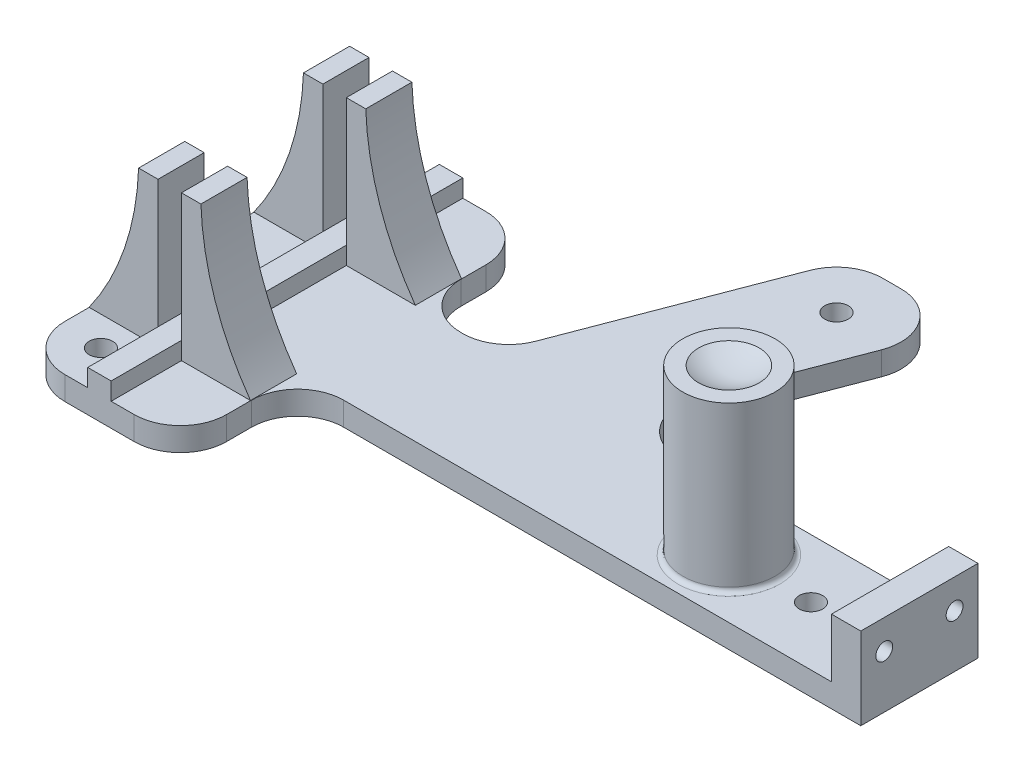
ISO-10303-21;
HEADER;
FILE_DESCRIPTION(('STEP AP214'),'2;1');
FILE_NAME('part.step','',(''),(''),'','','');
FILE_SCHEMA(('AUTOMOTIVE_DESIGN { 1 0 10303 214 1 1 1 1 }'));
ENDSEC;
DATA;
#1=APPLICATION_CONTEXT('core data for automotive mechanical design processes');
#2=APPLICATION_PROTOCOL_DEFINITION('international standard','automotive_design',2000,#1);
#3=PRODUCT_CONTEXT('',#1,'mechanical');
#4=PRODUCT('Part','Part','',(#3));
#5=PRODUCT_RELATED_PRODUCT_CATEGORY('part','',(#4));
#6=PRODUCT_DEFINITION_FORMATION('','',#4);
#7=PRODUCT_DEFINITION_CONTEXT('part definition',#1,'design');
#8=PRODUCT_DEFINITION('design','',#6,#7);
#9=PRODUCT_DEFINITION_SHAPE('','',#8);
#10=(LENGTH_UNIT() NAMED_UNIT(*) SI_UNIT(.MILLI.,.METRE.));
#11=(NAMED_UNIT(*) PLANE_ANGLE_UNIT() SI_UNIT($,.RADIAN.));
#12=(NAMED_UNIT(*) SI_UNIT($,.STERADIAN.) SOLID_ANGLE_UNIT());
#13=UNCERTAINTY_MEASURE_WITH_UNIT(LENGTH_MEASURE(1.E-05),#10,'distance_accuracy_value','');
#14=(GEOMETRIC_REPRESENTATION_CONTEXT(3) GLOBAL_UNCERTAINTY_ASSIGNED_CONTEXT((#13)) GLOBAL_UNIT_ASSIGNED_CONTEXT((#10,
#11,#12)) REPRESENTATION_CONTEXT('',''));
#15=CARTESIAN_POINT('',(0.,0.,0.));
#16=DIRECTION('',(0.,0.,1.));
#17=DIRECTION('',(1.,0.,0.));
#18=AXIS2_PLACEMENT_3D('',#15,#16,#17);
#19=CARTESIAN_POINT('',(30.08,0.,22.7));
#20=DIRECTION('',(0.,1.,0.));
#21=DIRECTION('',(0.,0.,1.));
#22=AXIS2_PLACEMENT_3D('',#19,#20,#21);
#23=PLANE('',#22);
#24=CARTESIAN_POINT('',(-6.03,0.,29.21));
#25=DIRECTION('',(0.,1.,0.));
#26=DIRECTION('',(0.,0.,1.));
#27=AXIS2_PLACEMENT_3D('',#24,#25,#26);
#28=CIRCLE('',#27,2.54);
#29=CARTESIAN_POINT('',(-6.03,0.,31.75));
#30=VERTEX_POINT('',#29);
#31=EDGE_CURVE('E439',#30,#30,#28,.F.);
#32=ORIENTED_EDGE('',*,*,#31,.T.);
#33=EDGE_LOOP('',(#32));
#34=FACE_BOUND('',#33,.T.);
#35=DIRECTION('',(1.,0.,0.));
#36=VECTOR('',#35,1.);
#37=CARTESIAN_POINT('',(-4.92,0.,38.1));
#38=LINE('',#37,#36);
#39=CARTESIAN_POINT('',(-4.92,0.,38.1));
#40=VERTEX_POINT('',#39);
#41=CARTESIAN_POINT('',(0.,0.,38.1));
#42=VERTEX_POINT('',#41);
#43=EDGE_CURVE('E56',#40,#42,#38,.T.);
#44=ORIENTED_EDGE('',*,*,#43,.T.);
#45=DIRECTION('',(0.,0.,1.));
#46=VECTOR('',#45,1.);
#47=CARTESIAN_POINT('',(0.,0.,-38.1));
#48=LINE('',#47,#46);
#49=CARTESIAN_POINT('',(0.,0.,22.86));
#50=VERTEX_POINT('',#49);
#51=EDGE_CURVE('E378',#50,#42,#48,.T.);
#52=ORIENTED_EDGE('',*,*,#51,.F.);
#53=DIRECTION('',(1.,0.,0.));
#54=VECTOR('',#53,1.);
#55=CARTESIAN_POINT('',(0.,0.,22.86));
#56=LINE('',#55,#54);
#57=CARTESIAN_POINT('',(-14.92,0.,22.86));
#58=VERTEX_POINT('',#57);
#59=EDGE_CURVE('E614',#58,#50,#56,.T.);
#60=ORIENTED_EDGE('',*,*,#59,.F.);
#61=DIRECTION('',(0.,0.,1.));
#62=VECTOR('',#61,1.);
#63=CARTESIAN_POINT('',(-14.92,0.,-28.1));
#64=LINE('',#63,#62);
#65=CARTESIAN_POINT('',(-14.92,0.,28.1));
#66=VERTEX_POINT('',#65);
#67=EDGE_CURVE('E680',#58,#66,#64,.T.);
#68=ORIENTED_EDGE('',*,*,#67,.T.);
#69=CARTESIAN_POINT('',(-4.92,0.,28.1));
#70=DIRECTION('',(0.,1.,0.));
#71=DIRECTION('',(0.,0.,1.));
#72=AXIS2_PLACEMENT_3D('',#69,#70,#71);
#73=CIRCLE('',#72,10.);
#74=EDGE_CURVE('E684',#66,#40,#73,.T.);
#75=ORIENTED_EDGE('',*,*,#74,.T.);
#76=EDGE_LOOP('',(#44,#52,#60,#68,#75));
#77=FACE_BOUND('',#76,.T.);
#78=ADVANCED_FACE('F32',(#34,#77),#23,.T.);
#79=DIRECTION('',(1.,0.,0.));
#80=VECTOR('',#79,1.);
#81=CARTESIAN_POINT('',(0.,0.,12.86));
#82=LINE('',#81,#80);
#83=CARTESIAN_POINT('',(-14.92,0.,12.86));
#84=VERTEX_POINT('',#83);
#85=CARTESIAN_POINT('',(0.,0.,12.86));
#86=VERTEX_POINT('',#85);
#87=EDGE_CURVE('E601',#84,#86,#82,.T.);
#88=ORIENTED_EDGE('',*,*,#87,.T.);
#89=CARTESIAN_POINT('',(0.,0.,-12.86));
#90=VERTEX_POINT('',#89);
#91=EDGE_CURVE('E1357',#90,#86,#48,.T.);
#92=ORIENTED_EDGE('',*,*,#91,.F.);
#93=DIRECTION('',(1.,0.,0.));
#94=VECTOR('',#93,1.);
#95=CARTESIAN_POINT('',(0.,0.,-12.86));
#96=LINE('',#95,#94);
#97=CARTESIAN_POINT('',(-14.92,0.,-12.86));
#98=VERTEX_POINT('',#97);
#99=EDGE_CURVE('E528',#98,#90,#96,.T.);
#100=ORIENTED_EDGE('',*,*,#99,.F.);
#101=EDGE_CURVE('E686',#98,#84,#64,.T.);
#102=ORIENTED_EDGE('',*,*,#101,.T.);
#103=EDGE_LOOP('',(#88,#92,#100,#102));
#104=FACE_BOUND('',#103,.T.);
#105=ADVANCED_FACE('F855',(#104),#23,.T.);
#106=CARTESIAN_POINT('',(-6.03,0.,-29.21));
#107=DIRECTION('',(0.,1.,0.));
#108=DIRECTION('',(0.,0.,1.));
#109=AXIS2_PLACEMENT_3D('',#106,#107,#108);
#110=CIRCLE('',#109,2.54);
#111=CARTESIAN_POINT('',(-6.03,0.,-26.67));
#112=VERTEX_POINT('',#111);
#113=EDGE_CURVE('E433',#112,#112,#110,.F.);
#114=ORIENTED_EDGE('',*,*,#113,.T.);
#115=EDGE_LOOP('',(#114));
#116=FACE_BOUND('',#115,.T.);
#117=DIRECTION('',(1.,0.,0.));
#118=VECTOR('',#117,1.);
#119=CARTESIAN_POINT('',(0.,0.,-22.86));
#120=LINE('',#119,#118);
#121=CARTESIAN_POINT('',(-14.92,0.,-22.86));
#122=VERTEX_POINT('',#121);
#123=CARTESIAN_POINT('',(0.,0.,-22.86));
#124=VERTEX_POINT('',#123);
#125=EDGE_CURVE('E541',#122,#124,#120,.T.);
#126=ORIENTED_EDGE('',*,*,#125,.T.);
#127=CARTESIAN_POINT('',(0.,0.,-38.1));
#128=VERTEX_POINT('',#127);
#129=EDGE_CURVE('E1354',#128,#124,#48,.T.);
#130=ORIENTED_EDGE('',*,*,#129,.F.);
#131=DIRECTION('',(-1.,0.,0.));
#132=VECTOR('',#131,1.);
#133=CARTESIAN_POINT('',(-4.92,0.,-38.1));
#134=LINE('',#133,#132);
#135=CARTESIAN_POINT('',(-4.91999999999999,0.,-38.1));
#136=VERTEX_POINT('',#135);
#137=EDGE_CURVE('E674',#128,#136,#134,.T.);
#138=ORIENTED_EDGE('',*,*,#137,.T.);
#139=CARTESIAN_POINT('',(-4.92,0.,-28.1));
#140=DIRECTION('',(0.,1.,0.));
#141=DIRECTION('',(0.,0.,1.));
#142=AXIS2_PLACEMENT_3D('',#139,#140,#141);
#143=CIRCLE('',#142,10.);
#144=CARTESIAN_POINT('',(-14.92,0.,-28.1));
#145=VERTEX_POINT('',#144);
#146=EDGE_CURVE('E677',#136,#145,#143,.T.);
#147=ORIENTED_EDGE('',*,*,#146,.T.);
#148=EDGE_CURVE('E681',#145,#122,#64,.T.);
#149=ORIENTED_EDGE('',*,*,#148,.T.);
#150=EDGE_LOOP('',(#126,#130,#138,#147,#149));
#151=FACE_BOUND('',#150,.T.);
#152=ADVANCED_FACE('F861',(#116,#151),#23,.T.);
#153=CARTESIAN_POINT('',(100.84,0.,0.));
#154=DIRECTION('',(0.,1.,0.));
#155=DIRECTION('',(0.,0.,1.));
#156=AXIS2_PLACEMENT_3D('',#153,#154,#155);
#157=CIRCLE('',#156,11.);
#158=CARTESIAN_POINT('',(100.84,0.,11.));
#159=VERTEX_POINT('',#158);
#160=EDGE_CURVE('E731',#159,#159,#157,.F.);
#161=ORIENTED_EDGE('',*,*,#160,.T.);
#162=EDGE_LOOP('',(#161));
#163=FACE_BOUND('',#162,.T.);
#164=CARTESIAN_POINT('',(67.0011743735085,0.,-57.15));
#165=DIRECTION('',(0.,1.,0.));
#166=DIRECTION('',(0.,0.,1.));
#167=AXIS2_PLACEMENT_3D('',#164,#165,#166);
#168=CIRCLE('',#167,2.54);
#169=CARTESIAN_POINT('',(67.0011743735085,0.,-54.61));
#170=VERTEX_POINT('',#169);
#171=EDGE_CURVE('E427',#170,#170,#168,.F.);
#172=ORIENTED_EDGE('',*,*,#171,.T.);
#173=EDGE_LOOP('',(#172));
#174=FACE_BOUND('',#173,.T.);
#175=CARTESIAN_POINT('',(118.62,0.,0.));
#176=DIRECTION('',(0.,1.,0.));
#177=DIRECTION('',(0.,0.,1.));
#178=AXIS2_PLACEMENT_3D('',#175,#176,#177);
#179=CIRCLE('',#178,2.54);
#180=CARTESIAN_POINT('',(118.62,0.,2.54));
#181=VERTEX_POINT('',#180);
#182=EDGE_CURVE('E421',#181,#181,#179,.F.);
#183=ORIENTED_EDGE('',*,*,#182,.T.);
#184=EDGE_LOOP('',(#183));
#185=FACE_BOUND('',#184,.T.);
#186=CARTESIAN_POINT('',(10.08,0.,-38.1));
#187=VERTEX_POINT('',#186);
#188=CARTESIAN_POINT('',(5.08000000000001,0.,-38.1));
#189=VERTEX_POINT('',#188);
#190=EDGE_CURVE('E675',#187,#189,#134,.T.);
#191=ORIENTED_EDGE('',*,*,#190,.T.);
#192=DIRECTION('',(0.,0.,-1.));
#193=VECTOR('',#192,1.);
#194=CARTESIAN_POINT('',(5.08,0.,-38.1));
#195=LINE('',#194,#193);
#196=CARTESIAN_POINT('',(5.08,0.,-22.86));
#197=VERTEX_POINT('',#196);
#198=EDGE_CURVE('E1326',#197,#189,#195,.T.);
#199=ORIENTED_EDGE('',*,*,#198,.F.);
#200=DIRECTION('',(1.,0.,0.));
#201=VECTOR('',#200,1.);
#202=CARTESIAN_POINT('',(5.08,0.,-22.86));
#203=LINE('',#202,#201);
#204=CARTESIAN_POINT('',(20.033299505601,0.,-22.86));
#205=VERTEX_POINT('',#204);
#206=EDGE_CURVE('E500',#197,#205,#203,.T.);
#207=ORIENTED_EDGE('',*,*,#206,.T.);
#208=DIRECTION('',(0.,0.,-1.));
#209=VECTOR('',#208,1.);
#210=CARTESIAN_POINT('',(20.033299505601,0.,-12.86));
#211=LINE('',#210,#209);
#212=CARTESIAN_POINT('',(20.033299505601,0.,-12.86));
#213=VERTEX_POINT('',#212);
#214=EDGE_CURVE('E516',#213,#205,#211,.T.);
#215=ORIENTED_EDGE('',*,*,#214,.F.);
#216=DIRECTION('',(1.,0.,0.));
#217=VECTOR('',#216,1.);
#218=CARTESIAN_POINT('',(5.08,0.,-12.86));
#219=LINE('',#218,#217);
#220=CARTESIAN_POINT('',(5.08,0.,-12.86));
#221=VERTEX_POINT('',#220);
#222=EDGE_CURVE('E504',#221,#213,#219,.T.);
#223=ORIENTED_EDGE('',*,*,#222,.F.);
#224=CARTESIAN_POINT('',(5.08,0.,12.86));
#225=VERTEX_POINT('',#224);
#226=EDGE_CURVE('E1346',#225,#221,#195,.T.);
#227=ORIENTED_EDGE('',*,*,#226,.F.);
#228=DIRECTION('',(1.,0.,0.));
#229=VECTOR('',#228,1.);
#230=CARTESIAN_POINT('',(5.08,0.,12.86));
#231=LINE('',#230,#229);
#232=CARTESIAN_POINT('',(20.033299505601,0.,12.86));
#233=VERTEX_POINT('',#232);
#234=EDGE_CURVE('E561',#225,#233,#231,.T.);
#235=ORIENTED_EDGE('',*,*,#234,.T.);
#236=DIRECTION('',(0.,0.,1.));
#237=VECTOR('',#236,1.);
#238=CARTESIAN_POINT('',(20.033299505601,0.,12.86));
#239=LINE('',#238,#237);
#240=CARTESIAN_POINT('',(20.033299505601,0.,22.86));
#241=VERTEX_POINT('',#240);
#242=EDGE_CURVE('E570',#233,#241,#239,.T.);
#243=ORIENTED_EDGE('',*,*,#242,.T.);
#244=DIRECTION('',(1.,0.,0.));
#245=VECTOR('',#244,1.);
#246=CARTESIAN_POINT('',(5.08,0.,22.86));
#247=LINE('',#246,#245);
#248=CARTESIAN_POINT('',(5.08,0.,22.86));
#249=VERTEX_POINT('',#248);
#250=EDGE_CURVE('E573',#249,#241,#247,.T.);
#251=ORIENTED_EDGE('',*,*,#250,.F.);
#252=CARTESIAN_POINT('',(5.08000000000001,0.,38.1));
#253=VERTEX_POINT('',#252);
#254=EDGE_CURVE('E48',#253,#249,#195,.T.);
#255=ORIENTED_EDGE('',*,*,#254,.F.);
#256=CARTESIAN_POINT('',(10.08,0.,38.1));
#257=VERTEX_POINT('',#256);
#258=EDGE_CURVE('E689',#253,#257,#38,.T.);
#259=ORIENTED_EDGE('',*,*,#258,.T.);
#260=CARTESIAN_POINT('',(10.08,0.,28.1));
#261=DIRECTION('',(0.,1.,0.));
#262=DIRECTION('',(0.,0.,-1.));
#263=AXIS2_PLACEMENT_3D('',#260,#261,#262);
#264=CIRCLE('',#263,10.);
#265=CARTESIAN_POINT('',(20.08,0.,28.1));
#266=VERTEX_POINT('',#265);
#267=EDGE_CURVE('E691',#257,#266,#264,.T.);
#268=ORIENTED_EDGE('',*,*,#267,.T.);
#269=DIRECTION('',(0.,0.,-1.));
#270=VECTOR('',#269,1.);
#271=CARTESIAN_POINT('',(20.08,0.,28.1));
#272=LINE('',#271,#270);
#273=CARTESIAN_POINT('',(20.08,0.,22.7));
#274=VERTEX_POINT('',#273);
#275=EDGE_CURVE('E694',#266,#274,#272,.T.);
#276=ORIENTED_EDGE('',*,*,#275,.T.);
#277=CARTESIAN_POINT('',(30.08,0.,22.7));
#278=DIRECTION('',(0.,-1.,0.));
#279=DIRECTION('',(0.,0.,1.));
#280=AXIS2_PLACEMENT_3D('',#277,#278,#279);
#281=CIRCLE('',#280,10.);
#282=CARTESIAN_POINT('',(30.08,0.,12.7));
#283=VERTEX_POINT('',#282);
#284=EDGE_CURVE('E697',#274,#283,#281,.T.);
#285=ORIENTED_EDGE('',*,*,#284,.T.);
#286=DIRECTION('',(1.,0.,0.));
#287=VECTOR('',#286,1.);
#288=CARTESIAN_POINT('',(30.08,0.,12.7));
#289=LINE('',#288,#287);
#290=CARTESIAN_POINT('',(135.765,0.,12.7));
#291=VERTEX_POINT('',#290);
#292=EDGE_CURVE('E625',#283,#291,#289,.T.);
#293=ORIENTED_EDGE('',*,*,#292,.T.);
#294=DIRECTION('',(0.,0.,-1.));
#295=VECTOR('',#294,1.);
#296=CARTESIAN_POINT('',(135.765,0.,-12.7));
#297=LINE('',#296,#295);
#298=CARTESIAN_POINT('',(135.765,0.,-12.7));
#299=VERTEX_POINT('',#298);
#300=EDGE_CURVE('E393',#291,#299,#297,.T.);
#301=ORIENTED_EDGE('',*,*,#300,.T.);
#302=DIRECTION('',(-1.,0.,0.));
#303=VECTOR('',#302,1.);
#304=CARTESIAN_POINT('',(30.08,0.,-12.7));
#305=LINE('',#304,#303);
#306=CARTESIAN_POINT('',(77.2590686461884,0.,-12.7));
#307=VERTEX_POINT('',#306);
#308=EDGE_CURVE('E663',#299,#307,#305,.T.);
#309=ORIENTED_EDGE('',*,*,#308,.T.);
#310=CARTESIAN_POINT('',(77.2590686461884,0.,-22.7));
#311=DIRECTION('',(0.,1.,0.));
#312=DIRECTION('',(0.,0.,1.));
#313=AXIS2_PLACEMENT_3D('',#310,#311,#312);
#314=CIRCLE('',#313,10.);
#315=CARTESIAN_POINT('',(67.9161394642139,0.,-26.2650630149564));
#316=VERTEX_POINT('',#315);
#317=EDGE_CURVE('E41',#307,#316,#314,.F.);
#318=ORIENTED_EDGE('',*,*,#317,.T.);
#319=DIRECTION('',(0.356506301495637,0.,-0.934292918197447));
#320=VECTOR('',#319,1.);
#321=CARTESIAN_POINT('',(78.8864797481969,0.,-55.0149369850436));
#322=LINE('',#321,#320);
#323=CARTESIAN_POINT('',(78.8864797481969,0.,-55.0149369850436));
#324=VERTEX_POINT('',#323);
#325=EDGE_CURVE('E452',#316,#324,#322,.T.);
#326=ORIENTED_EDGE('',*,*,#325,.T.);
#327=CARTESIAN_POINT('',(69.5435505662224,0.,-58.58));
#328=DIRECTION('',(0.,1.,0.));
#329=DIRECTION('',(0.,0.,-1.));
#330=AXIS2_PLACEMENT_3D('',#327,#328,#329);
#331=CIRCLE('',#330,10.);
#332=CARTESIAN_POINT('',(69.5435505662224,0.,-68.58));
#333=VERTEX_POINT('',#332);
#334=EDGE_CURVE('E470',#324,#333,#331,.T.);
#335=ORIENTED_EDGE('',*,*,#334,.T.);
#336=DIRECTION('',(-1.,0.,0.));
#337=VECTOR('',#336,1.);
#338=CARTESIAN_POINT('',(65.5501133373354,0.,-68.58));
#339=LINE('',#338,#337);
#340=CARTESIAN_POINT('',(65.5501133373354,0.,-68.58));
#341=VERTEX_POINT('',#340);
#342=EDGE_CURVE('E473',#333,#341,#339,.T.);
#343=ORIENTED_EDGE('',*,*,#342,.T.);
#344=CARTESIAN_POINT('',(65.5501133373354,0.,-58.58));
#345=DIRECTION('',(0.,1.,0.));
#346=DIRECTION('',(0.,0.,-1.));
#347=AXIS2_PLACEMENT_3D('',#344,#345,#346);
#348=CIRCLE('',#347,10.);
#349=CARTESIAN_POINT('',(56.2071841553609,0.,-62.1450630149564));
#350=VERTEX_POINT('',#349);
#351=EDGE_CURVE('E476',#341,#350,#348,.T.);
#352=ORIENTED_EDGE('',*,*,#351,.T.);
#353=DIRECTION('',(-0.356506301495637,0.,0.934292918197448));
#354=VECTOR('',#353,1.);
#355=CARTESIAN_POINT('',(37.34,0.,-12.7));
#356=LINE('',#355,#354);
#357=CARTESIAN_POINT('',(39.7954350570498,0.,-19.1349369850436));
#358=VERTEX_POINT('',#357);
#359=EDGE_CURVE('E456',#350,#358,#356,.T.);
#360=ORIENTED_EDGE('',*,*,#359,.T.);
#361=CARTESIAN_POINT('',(30.4525058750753,0.,-22.7));
#362=DIRECTION('',(0.,1.,0.));
#363=DIRECTION('',(0.,0.,1.));
#364=AXIS2_PLACEMENT_3D('',#361,#362,#363);
#365=CIRCLE('',#364,10.);
#366=CARTESIAN_POINT('',(30.4525058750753,0.,-12.7));
#367=VERTEX_POINT('',#366);
#368=EDGE_CURVE('E739',#358,#367,#365,.F.);
#369=ORIENTED_EDGE('',*,*,#368,.T.);
#370=CARTESIAN_POINT('',(30.08,0.,-12.7));
#371=VERTEX_POINT('',#370);
#372=EDGE_CURVE('E617',#367,#371,#305,.T.);
#373=ORIENTED_EDGE('',*,*,#372,.T.);
#374=CARTESIAN_POINT('',(30.08,0.,-22.7));
#375=DIRECTION('',(0.,-1.,0.));
#376=DIRECTION('',(0.,0.,1.));
#377=AXIS2_PLACEMENT_3D('',#374,#375,#376);
#378=CIRCLE('',#377,10.);
#379=CARTESIAN_POINT('',(20.08,0.,-22.7));
#380=VERTEX_POINT('',#379);
#381=EDGE_CURVE('E665',#371,#380,#378,.T.);
#382=ORIENTED_EDGE('',*,*,#381,.T.);
#383=DIRECTION('',(0.,0.,-1.));
#384=VECTOR('',#383,1.);
#385=CARTESIAN_POINT('',(20.08,0.,-28.1));
#386=LINE('',#385,#384);
#387=CARTESIAN_POINT('',(20.08,0.,-28.1));
#388=VERTEX_POINT('',#387);
#389=EDGE_CURVE('E668',#380,#388,#386,.T.);
#390=ORIENTED_EDGE('',*,*,#389,.T.);
#391=CARTESIAN_POINT('',(10.08,0.,-28.1));
#392=DIRECTION('',(0.,1.,0.));
#393=DIRECTION('',(0.,0.,1.));
#394=AXIS2_PLACEMENT_3D('',#391,#392,#393);
#395=CIRCLE('',#394,10.);
#396=EDGE_CURVE('E671',#388,#187,#395,.T.);
#397=ORIENTED_EDGE('',*,*,#396,.T.);
#398=EDGE_LOOP('',(#191,#199,#207,#215,#223,#227,#235,#243,#251,#255,#259,#268,#276,#285,#293,
#301,#309,#318,#326,#335,#343,#352,#360,#369,#373,#382,#390,#397));
#399=FACE_BOUND('',#398,.T.);
#400=ADVANCED_FACE('F750',(#163,#174,#185,#399),#23,.T.);
#401=CARTESIAN_POINT('',(30.08,-5.08,-12.7));
#402=DIRECTION('',(0.,0.,-1.));
#403=DIRECTION('',(-1.,0.,0.));
#404=AXIS2_PLACEMENT_3D('',#401,#402,#403);
#405=PLANE('',#404);
#406=ORIENTED_EDGE('',*,*,#372,.F.);
#407=DIRECTION('',(0.,1.,0.));
#408=VECTOR('',#407,1.);
#409=CARTESIAN_POINT('',(30.4525058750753,-5.08,-12.7));
#410=LINE('',#409,#408);
#411=CARTESIAN_POINT('',(30.4525058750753,-5.08,-12.7));
#412=VERTEX_POINT('',#411);
#413=EDGE_CURVE('E737',#367,#412,#410,.F.);
#414=ORIENTED_EDGE('',*,*,#413,.T.);
#415=DIRECTION('',(-1.,0.,0.));
#416=VECTOR('',#415,1.);
#417=CARTESIAN_POINT('',(132.59,-5.08,-12.7));
#418=LINE('',#417,#416);
#419=CARTESIAN_POINT('',(30.08,-5.08,-12.7));
#420=VERTEX_POINT('',#419);
#421=EDGE_CURVE('E624',#412,#420,#418,.T.);
#422=ORIENTED_EDGE('',*,*,#421,.T.);
#423=DIRECTION('',(0.,1.,0.));
#424=VECTOR('',#423,1.);
#425=CARTESIAN_POINT('',(30.08,-5.08,-12.7));
#426=LINE('',#425,#424);
#427=EDGE_CURVE('E662',#420,#371,#426,.T.);
#428=ORIENTED_EDGE('',*,*,#427,.T.);
#429=EDGE_LOOP('',(#406,#414,#422,#428));
#430=FACE_BOUND('',#429,.T.);
#431=ADVANCED_FACE('F826',(#430),#405,.T.);
#432=CARTESIAN_POINT('',(30.08,-5.08,12.7));
#433=DIRECTION('',(0.,0.,1.));
#434=DIRECTION('',(1.,0.,0.));
#435=AXIS2_PLACEMENT_3D('',#432,#433,#434);
#436=PLANE('',#435);
#437=DIRECTION('',(0.,1.,0.));
#438=VECTOR('',#437,1.);
#439=CARTESIAN_POINT('',(135.765,0.,12.7));
#440=LINE('',#439,#438);
#441=CARTESIAN_POINT('',(135.765,12.7,12.7));
#442=VERTEX_POINT('',#441);
#443=EDGE_CURVE('E396',#291,#442,#440,.T.);
#444=ORIENTED_EDGE('',*,*,#443,.F.);
#445=ORIENTED_EDGE('',*,*,#292,.F.);
#446=DIRECTION('',(0.,1.,0.));
#447=VECTOR('',#446,1.);
#448=CARTESIAN_POINT('',(30.08,-5.08,12.7));
#449=LINE('',#448,#447);
#450=CARTESIAN_POINT('',(30.08,-5.08,12.7));
#451=VERTEX_POINT('',#450);
#452=EDGE_CURVE('E701',#451,#283,#449,.T.);
#453=ORIENTED_EDGE('',*,*,#452,.F.);
#454=DIRECTION('',(1.,0.,0.));
#455=VECTOR('',#454,1.);
#456=CARTESIAN_POINT('',(132.59,-5.08,12.7));
#457=LINE('',#456,#455);
#458=CARTESIAN_POINT('',(142.115,-5.08,12.7));
#459=VERTEX_POINT('',#458);
#460=EDGE_CURVE('E622',#451,#459,#457,.T.);
#461=ORIENTED_EDGE('',*,*,#460,.T.);
#462=DIRECTION('',(0.,1.,0.));
#463=VECTOR('',#462,1.);
#464=CARTESIAN_POINT('',(142.115,-5.08,12.7));
#465=LINE('',#464,#463);
#466=CARTESIAN_POINT('',(142.115,12.7,12.7));
#467=VERTEX_POINT('',#466);
#468=EDGE_CURVE('E415',#459,#467,#465,.T.);
#469=ORIENTED_EDGE('',*,*,#468,.T.);
#470=DIRECTION('',(1.,0.,0.));
#471=VECTOR('',#470,1.);
#472=CARTESIAN_POINT('',(132.59,12.7,12.7));
#473=LINE('',#472,#471);
#474=EDGE_CURVE('E450',#442,#467,#473,.T.);
#475=ORIENTED_EDGE('',*,*,#474,.F.);
#476=EDGE_LOOP('',(#444,#445,#453,#461,#469,#475));
#477=FACE_BOUND('',#476,.T.);
#478=ADVANCED_FACE('F777',(#477),#436,.T.);
#479=CARTESIAN_POINT('',(30.08,-5.08,22.7));
#480=DIRECTION('',(0.,1.,0.));
#481=DIRECTION('',(0.,0.,1.));
#482=AXIS2_PLACEMENT_3D('',#479,#480,#481);
#483=CYLINDRICAL_SURFACE('',#482,10.);
#484=ORIENTED_EDGE('',*,*,#284,.F.);
#485=DIRECTION('',(0.,1.,0.));
#486=VECTOR('',#485,1.);
#487=CARTESIAN_POINT('',(20.08,-5.08,22.7));
#488=LINE('',#487,#486);
#489=CARTESIAN_POINT('',(20.08,-5.08,22.7));
#490=VERTEX_POINT('',#489);
#491=EDGE_CURVE('E703',#490,#274,#488,.T.);
#492=ORIENTED_EDGE('',*,*,#491,.F.);
#493=CARTESIAN_POINT('',(30.08,-5.08,22.7));
#494=DIRECTION('',(0.,-1.,0.));
#495=DIRECTION('',(0.,0.,1.));
#496=AXIS2_PLACEMENT_3D('',#493,#494,#495);
#497=CIRCLE('',#496,10.);
#498=EDGE_CURVE('E659',#490,#451,#497,.T.);
#499=ORIENTED_EDGE('',*,*,#498,.T.);
#500=ORIENTED_EDGE('',*,*,#452,.T.);
#501=EDGE_LOOP('',(#484,#492,#499,#500));
#502=FACE_BOUND('',#501,.T.);
#503=ADVANCED_FACE('F780',(#502),#483,.F.);
#504=CARTESIAN_POINT('',(20.08,-5.08,28.1));
#505=DIRECTION('',(1.,0.,0.));
#506=DIRECTION('',(0.,0.,-1.));
#507=AXIS2_PLACEMENT_3D('',#504,#505,#506);
#508=PLANE('',#507);
#509=ORIENTED_EDGE('',*,*,#275,.F.);
#510=DIRECTION('',(0.,1.,0.));
#511=VECTOR('',#510,1.);
#512=CARTESIAN_POINT('',(20.08,-5.08,28.1));
#513=LINE('',#512,#511);
#514=CARTESIAN_POINT('',(20.08,-5.08,28.1));
#515=VERTEX_POINT('',#514);
#516=EDGE_CURVE('E705',#515,#266,#513,.T.);
#517=ORIENTED_EDGE('',*,*,#516,.F.);
#518=DIRECTION('',(0.,0.,-1.));
#519=VECTOR('',#518,1.);
#520=CARTESIAN_POINT('',(20.08,-5.08,28.1));
#521=LINE('',#520,#519);
#522=EDGE_CURVE('E656',#515,#490,#521,.T.);
#523=ORIENTED_EDGE('',*,*,#522,.T.);
#524=ORIENTED_EDGE('',*,*,#491,.T.);
#525=EDGE_LOOP('',(#509,#517,#523,#524));
#526=FACE_BOUND('',#525,.T.);
#527=ADVANCED_FACE('F783',(#526),#508,.T.);
#528=CARTESIAN_POINT('',(10.08,-5.08,28.1));
#529=DIRECTION('',(0.,1.,0.));
#530=DIRECTION('',(0.,0.,1.));
#531=AXIS2_PLACEMENT_3D('',#528,#529,#530);
#532=CYLINDRICAL_SURFACE('',#531,10.);
#533=ORIENTED_EDGE('',*,*,#267,.F.);
#534=DIRECTION('',(0.,1.,0.));
#535=VECTOR('',#534,1.);
#536=CARTESIAN_POINT('',(10.08,-5.08,38.1));
#537=LINE('',#536,#535);
#538=CARTESIAN_POINT('',(10.08,-5.08,38.1));
#539=VERTEX_POINT('',#538);
#540=EDGE_CURVE('E707',#539,#257,#537,.T.);
#541=ORIENTED_EDGE('',*,*,#540,.F.);
#542=CARTESIAN_POINT('',(10.08,-5.08,28.1));
#543=DIRECTION('',(0.,1.,0.));
#544=DIRECTION('',(0.,0.,-1.));
#545=AXIS2_PLACEMENT_3D('',#542,#543,#544);
#546=CIRCLE('',#545,10.);
#547=EDGE_CURVE('E653',#539,#515,#546,.T.);
#548=ORIENTED_EDGE('',*,*,#547,.T.);
#549=ORIENTED_EDGE('',*,*,#516,.T.);
#550=EDGE_LOOP('',(#533,#541,#548,#549));
#551=FACE_BOUND('',#550,.T.);
#552=ADVANCED_FACE('F788',(#551),#532,.T.);
#553=CARTESIAN_POINT('',(-4.92,-5.08,38.1));
#554=DIRECTION('',(0.,0.,1.));
#555=DIRECTION('',(1.,0.,0.));
#556=AXIS2_PLACEMENT_3D('',#553,#554,#555);
#557=PLANE('',#556);
#558=ORIENTED_EDGE('',*,*,#43,.F.);
#559=DIRECTION('',(0.,1.,0.));
#560=VECTOR('',#559,1.);
#561=CARTESIAN_POINT('',(-4.92,-5.08,38.1));
#562=LINE('',#561,#560);
#563=CARTESIAN_POINT('',(-4.92,-5.08,38.1));
#564=VERTEX_POINT('',#563);
#565=EDGE_CURVE('E710',#564,#40,#562,.T.);
#566=ORIENTED_EDGE('',*,*,#565,.F.);
#567=DIRECTION('',(1.,0.,0.));
#568=VECTOR('',#567,1.);
#569=CARTESIAN_POINT('',(-4.92,-5.08,38.1));
#570=LINE('',#569,#568);
#571=EDGE_CURVE('E650',#564,#539,#570,.T.);
#572=ORIENTED_EDGE('',*,*,#571,.T.);
#573=ORIENTED_EDGE('',*,*,#540,.T.);
#574=ORIENTED_EDGE('',*,*,#258,.F.);
#575=DIRECTION('',(0.,-1.,0.));
#576=VECTOR('',#575,1.);
#577=CARTESIAN_POINT('',(5.08000000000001,3.81,38.1));
#578=LINE('',#577,#576);
#579=CARTESIAN_POINT('',(5.08000000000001,3.81,38.1));
#580=VERTEX_POINT('',#579);
#581=EDGE_CURVE('E373',#580,#253,#578,.T.);
#582=ORIENTED_EDGE('',*,*,#581,.F.);
#583=DIRECTION('',(1.,0.,0.));
#584=VECTOR('',#583,1.);
#585=CARTESIAN_POINT('',(0.,3.81,38.1));
#586=LINE('',#585,#584);
#587=CARTESIAN_POINT('',(0.,3.81,38.1));
#588=VERTEX_POINT('',#587);
#589=EDGE_CURVE('E359',#588,#580,#586,.T.);
#590=ORIENTED_EDGE('',*,*,#589,.F.);
#591=DIRECTION('',(0.,-1.,0.));
#592=VECTOR('',#591,1.);
#593=CARTESIAN_POINT('',(0.,3.81,38.1));
#594=LINE('',#593,#592);
#595=EDGE_CURVE('E371',#588,#42,#594,.T.);
#596=ORIENTED_EDGE('',*,*,#595,.T.);
#597=EDGE_LOOP('',(#558,#566,#572,#573,#574,#582,#590,#596));
#598=FACE_BOUND('',#597,.T.);
#599=ADVANCED_FACE('F370',(#598),#557,.T.);
#600=CARTESIAN_POINT('',(-4.92,-5.08,28.1));
#601=DIRECTION('',(0.,1.,0.));
#602=DIRECTION('',(0.,0.,1.));
#603=AXIS2_PLACEMENT_3D('',#600,#601,#602);
#604=CYLINDRICAL_SURFACE('',#603,10.);
#605=ORIENTED_EDGE('',*,*,#74,.F.);
#606=DIRECTION('',(0.,1.,0.));
#607=VECTOR('',#606,1.);
#608=CARTESIAN_POINT('',(-14.92,-5.08,28.1));
#609=LINE('',#608,#607);
#610=CARTESIAN_POINT('',(-14.92,-5.08,28.1));
#611=VERTEX_POINT('',#610);
#612=EDGE_CURVE('E712',#611,#66,#609,.T.);
#613=ORIENTED_EDGE('',*,*,#612,.F.);
#614=CARTESIAN_POINT('',(-4.92,-5.08,28.1));
#615=DIRECTION('',(0.,1.,0.));
#616=DIRECTION('',(0.,0.,1.));
#617=AXIS2_PLACEMENT_3D('',#614,#615,#616);
#618=CIRCLE('',#617,10.);
#619=EDGE_CURVE('E647',#611,#564,#618,.T.);
#620=ORIENTED_EDGE('',*,*,#619,.T.);
#621=ORIENTED_EDGE('',*,*,#565,.T.);
#622=EDGE_LOOP('',(#605,#613,#620,#621));
#623=FACE_BOUND('',#622,.T.);
#624=ADVANCED_FACE('F793',(#623),#604,.T.);
#625=CARTESIAN_POINT('',(-14.92,-5.08,-28.1));
#626=DIRECTION('',(-1.,0.,0.));
#627=DIRECTION('',(0.,0.,1.));
#628=AXIS2_PLACEMENT_3D('',#625,#626,#627);
#629=PLANE('',#628);
#630=ORIENTED_EDGE('',*,*,#148,.F.);
#631=DIRECTION('',(0.,1.,0.));
#632=VECTOR('',#631,1.);
#633=CARTESIAN_POINT('',(-14.92,-5.08,-28.1));
#634=LINE('',#633,#632);
#635=CARTESIAN_POINT('',(-14.92,-5.08,-28.1));
#636=VERTEX_POINT('',#635);
#637=EDGE_CURVE('E715',#636,#145,#634,.T.);
#638=ORIENTED_EDGE('',*,*,#637,.F.);
#639=DIRECTION('',(0.,0.,1.));
#640=VECTOR('',#639,1.);
#641=CARTESIAN_POINT('',(-14.92,-5.08,-28.1));
#642=LINE('',#641,#640);
#643=EDGE_CURVE('E644',#636,#611,#642,.T.);
#644=ORIENTED_EDGE('',*,*,#643,.T.);
#645=ORIENTED_EDGE('',*,*,#612,.T.);
#646=ORIENTED_EDGE('',*,*,#67,.F.);
#647=EDGE_CURVE('E687',#84,#58,#64,.T.);
#648=ORIENTED_EDGE('',*,*,#647,.F.);
#649=ORIENTED_EDGE('',*,*,#101,.F.);
#650=EDGE_CURVE('E685',#122,#98,#64,.T.);
#651=ORIENTED_EDGE('',*,*,#650,.F.);
#652=EDGE_LOOP('',(#630,#638,#644,#645,#646,#648,#649,#651));
#653=FACE_BOUND('',#652,.T.);
#654=ADVANCED_FACE('F797',(#653),#629,.T.);
#655=CARTESIAN_POINT('',(-4.92,-5.08,-28.1));
#656=DIRECTION('',(0.,1.,0.));
#657=DIRECTION('',(0.,0.,1.));
#658=AXIS2_PLACEMENT_3D('',#655,#656,#657);
#659=CYLINDRICAL_SURFACE('',#658,10.);
#660=ORIENTED_EDGE('',*,*,#146,.F.);
#661=DIRECTION('',(0.,1.,0.));
#662=VECTOR('',#661,1.);
#663=CARTESIAN_POINT('',(-4.91999999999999,-5.08,-38.1));
#664=LINE('',#663,#662);
#665=CARTESIAN_POINT('',(-4.91999999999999,-5.08,-38.1));
#666=VERTEX_POINT('',#665);
#667=EDGE_CURVE('E717',#666,#136,#664,.T.);
#668=ORIENTED_EDGE('',*,*,#667,.F.);
#669=CARTESIAN_POINT('',(-4.92,-5.08,-28.1));
#670=DIRECTION('',(0.,1.,0.));
#671=DIRECTION('',(0.,0.,1.));
#672=AXIS2_PLACEMENT_3D('',#669,#670,#671);
#673=CIRCLE('',#672,10.);
#674=EDGE_CURVE('E641',#666,#636,#673,.T.);
#675=ORIENTED_EDGE('',*,*,#674,.T.);
#676=ORIENTED_EDGE('',*,*,#637,.T.);
#677=EDGE_LOOP('',(#660,#668,#675,#676));
#678=FACE_BOUND('',#677,.T.);
#679=ADVANCED_FACE('F803',(#678),#659,.T.);
#680=CARTESIAN_POINT('',(-4.92,-5.08,-38.1));
#681=DIRECTION('',(0.,0.,-1.));
#682=DIRECTION('',(-1.,0.,0.));
#683=AXIS2_PLACEMENT_3D('',#680,#681,#682);
#684=PLANE('',#683);
#685=ORIENTED_EDGE('',*,*,#190,.F.);
#686=DIRECTION('',(0.,1.,0.));
#687=VECTOR('',#686,1.);
#688=CARTESIAN_POINT('',(10.08,-5.08,-38.1));
#689=LINE('',#688,#687);
#690=CARTESIAN_POINT('',(10.08,-5.08,-38.1));
#691=VERTEX_POINT('',#690);
#692=EDGE_CURVE('E720',#691,#187,#689,.T.);
#693=ORIENTED_EDGE('',*,*,#692,.F.);
#694=DIRECTION('',(-1.,0.,0.));
#695=VECTOR('',#694,1.);
#696=CARTESIAN_POINT('',(-4.92,-5.08,-38.1));
#697=LINE('',#696,#695);
#698=EDGE_CURVE('E638',#691,#666,#697,.T.);
#699=ORIENTED_EDGE('',*,*,#698,.T.);
#700=ORIENTED_EDGE('',*,*,#667,.T.);
#701=ORIENTED_EDGE('',*,*,#137,.F.);
#702=DIRECTION('',(0.,-1.,0.));
#703=VECTOR('',#702,1.);
#704=CARTESIAN_POINT('',(0.,3.81,-38.1));
#705=LINE('',#704,#703);
#706=CARTESIAN_POINT('',(0.,3.81,-38.1));
#707=VERTEX_POINT('',#706);
#708=EDGE_CURVE('E1353',#707,#128,#705,.T.);
#709=ORIENTED_EDGE('',*,*,#708,.F.);
#710=DIRECTION('',(-1.,0.,0.));
#711=VECTOR('',#710,1.);
#712=CARTESIAN_POINT('',(0.,3.81,-38.1));
#713=LINE('',#712,#711);
#714=CARTESIAN_POINT('',(5.08,3.81,-38.1));
#715=VERTEX_POINT('',#714);
#716=EDGE_CURVE('E1351',#715,#707,#713,.T.);
#717=ORIENTED_EDGE('',*,*,#716,.F.);
#718=DIRECTION('',(0.,-1.,0.));
#719=VECTOR('',#718,1.);
#720=CARTESIAN_POINT('',(5.08,3.81,-38.1));
#721=LINE('',#720,#719);
#722=EDGE_CURVE('E384',#715,#189,#721,.T.);
#723=ORIENTED_EDGE('',*,*,#722,.T.);
#724=EDGE_LOOP('',(#685,#693,#699,#700,#701,#709,#717,#723));
#725=FACE_BOUND('',#724,.T.);
#726=ADVANCED_FACE('F807',(#725),#684,.T.);
#727=CARTESIAN_POINT('',(10.08,-5.08,-28.1));
#728=DIRECTION('',(0.,1.,0.));
#729=DIRECTION('',(0.,0.,1.));
#730=AXIS2_PLACEMENT_3D('',#727,#728,#729);
#731=CYLINDRICAL_SURFACE('',#730,10.);
#732=ORIENTED_EDGE('',*,*,#396,.F.);
#733=DIRECTION('',(0.,1.,0.));
#734=VECTOR('',#733,1.);
#735=CARTESIAN_POINT('',(20.08,-5.08,-28.1));
#736=LINE('',#735,#734);
#737=CARTESIAN_POINT('',(20.08,-5.08,-28.1));
#738=VERTEX_POINT('',#737);
#739=EDGE_CURVE('E722',#738,#388,#736,.T.);
#740=ORIENTED_EDGE('',*,*,#739,.F.);
#741=CARTESIAN_POINT('',(10.08,-5.08,-28.1));
#742=DIRECTION('',(0.,1.,0.));
#743=DIRECTION('',(0.,0.,1.));
#744=AXIS2_PLACEMENT_3D('',#741,#742,#743);
#745=CIRCLE('',#744,10.);
#746=EDGE_CURVE('E635',#738,#691,#745,.T.);
#747=ORIENTED_EDGE('',*,*,#746,.T.);
#748=ORIENTED_EDGE('',*,*,#692,.T.);
#749=EDGE_LOOP('',(#732,#740,#747,#748));
#750=FACE_BOUND('',#749,.T.);
#751=ADVANCED_FACE('F814',(#750),#731,.T.);
#752=CARTESIAN_POINT('',(20.08,-5.08,-28.1));
#753=DIRECTION('',(1.,0.,0.));
#754=DIRECTION('',(0.,0.,-1.));
#755=AXIS2_PLACEMENT_3D('',#752,#753,#754);
#756=PLANE('',#755);
#757=ORIENTED_EDGE('',*,*,#389,.F.);
#758=DIRECTION('',(0.,1.,0.));
#759=VECTOR('',#758,1.);
#760=CARTESIAN_POINT('',(20.08,-5.08,-22.7));
#761=LINE('',#760,#759);
#762=CARTESIAN_POINT('',(20.08,-5.08,-22.7));
#763=VERTEX_POINT('',#762);
#764=EDGE_CURVE('E724',#763,#380,#761,.T.);
#765=ORIENTED_EDGE('',*,*,#764,.F.);
#766=DIRECTION('',(0.,0.,-1.));
#767=VECTOR('',#766,1.);
#768=CARTESIAN_POINT('',(20.08,-5.08,-28.1));
#769=LINE('',#768,#767);
#770=EDGE_CURVE('E632',#763,#738,#769,.T.);
#771=ORIENTED_EDGE('',*,*,#770,.T.);
#772=ORIENTED_EDGE('',*,*,#739,.T.);
#773=EDGE_LOOP('',(#757,#765,#771,#772));
#774=FACE_BOUND('',#773,.T.);
#775=ADVANCED_FACE('F817',(#774),#756,.T.);
#776=CARTESIAN_POINT('',(30.08,-5.08,-22.7));
#777=DIRECTION('',(0.,1.,0.));
#778=DIRECTION('',(0.,0.,1.));
#779=AXIS2_PLACEMENT_3D('',#776,#777,#778);
#780=CYLINDRICAL_SURFACE('',#779,10.);
#781=ORIENTED_EDGE('',*,*,#381,.F.);
#782=ORIENTED_EDGE('',*,*,#427,.F.);
#783=CARTESIAN_POINT('',(30.08,-5.08,-22.7));
#784=DIRECTION('',(0.,-1.,0.));
#785=DIRECTION('',(0.,0.,1.));
#786=AXIS2_PLACEMENT_3D('',#783,#784,#785);
#787=CIRCLE('',#786,10.);
#788=EDGE_CURVE('E629',#420,#763,#787,.T.);
#789=ORIENTED_EDGE('',*,*,#788,.T.);
#790=ORIENTED_EDGE('',*,*,#764,.T.);
#791=EDGE_LOOP('',(#781,#782,#789,#790));
#792=FACE_BOUND('',#791,.T.);
#793=ADVANCED_FACE('F823',(#792),#780,.F.);
#794=DIRECTION('',(0.,1.,0.));
#795=VECTOR('',#794,1.);
#796=CARTESIAN_POINT('',(135.765,0.,-12.7));
#797=LINE('',#796,#795);
#798=CARTESIAN_POINT('',(135.765,12.7,-12.7));
#799=VERTEX_POINT('',#798);
#800=EDGE_CURVE('E398',#299,#799,#797,.T.);
#801=ORIENTED_EDGE('',*,*,#800,.T.);
#802=DIRECTION('',(-1.,0.,0.));
#803=VECTOR('',#802,1.);
#804=CARTESIAN_POINT('',(132.59,12.7,-12.7));
#805=LINE('',#804,#803);
#806=CARTESIAN_POINT('',(142.115,12.7,-12.7));
#807=VERTEX_POINT('',#806);
#808=EDGE_CURVE('E445',#807,#799,#805,.T.);
#809=ORIENTED_EDGE('',*,*,#808,.F.);
#810=DIRECTION('',(0.,1.,0.));
#811=VECTOR('',#810,1.);
#812=CARTESIAN_POINT('',(142.115,-5.08,-12.7));
#813=LINE('',#812,#811);
#814=CARTESIAN_POINT('',(142.115,-5.08,-12.7));
#815=VERTEX_POINT('',#814);
#816=EDGE_CURVE('E418',#815,#807,#813,.T.);
#817=ORIENTED_EDGE('',*,*,#816,.F.);
#818=CARTESIAN_POINT('',(77.2590686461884,-5.08,-12.7));
#819=VERTEX_POINT('',#818);
#820=EDGE_CURVE('E626',#815,#819,#418,.T.);
#821=ORIENTED_EDGE('',*,*,#820,.T.);
#822=DIRECTION('',(0.,1.,0.));
#823=VECTOR('',#822,1.);
#824=CARTESIAN_POINT('',(77.2590686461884,0.,-12.7));
#825=LINE('',#824,#823);
#826=EDGE_CURVE('E743',#819,#307,#825,.T.);
#827=ORIENTED_EDGE('',*,*,#826,.T.);
#828=ORIENTED_EDGE('',*,*,#308,.F.);
#829=EDGE_LOOP('',(#801,#809,#817,#821,#827,#828));
#830=FACE_BOUND('',#829,.T.);
#831=ADVANCED_FACE('F766',(#830),#405,.T.);
#832=CARTESIAN_POINT('',(30.08,-5.08,22.7));
#833=DIRECTION('',(0.,1.,0.));
#834=DIRECTION('',(0.,0.,1.));
#835=AXIS2_PLACEMENT_3D('',#832,#833,#834);
#836=PLANE('',#835);
#837=CARTESIAN_POINT('',(118.62,-5.08,0.));
#838=DIRECTION('',(0.,-1.,0.));
#839=DIRECTION('',(0.,0.,-1.));
#840=AXIS2_PLACEMENT_3D('',#837,#838,#839);
#841=CIRCLE('',#840,2.54);
#842=CARTESIAN_POINT('',(118.62,-5.08,-2.54));
#843=VERTEX_POINT('',#842);
#844=EDGE_CURVE('E424',#843,#843,#841,.T.);
#845=ORIENTED_EDGE('',*,*,#844,.F.);
#846=EDGE_LOOP('',(#845));
#847=FACE_BOUND('',#846,.T.);
#848=CARTESIAN_POINT('',(67.0011743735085,-5.08,-57.15));
#849=DIRECTION('',(0.,-1.,0.));
#850=DIRECTION('',(0.,0.,-1.));
#851=AXIS2_PLACEMENT_3D('',#848,#849,#850);
#852=CIRCLE('',#851,2.54);
#853=CARTESIAN_POINT('',(67.0011743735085,-5.08,-59.69));
#854=VERTEX_POINT('',#853);
#855=EDGE_CURVE('E430',#854,#854,#852,.T.);
#856=ORIENTED_EDGE('',*,*,#855,.F.);
#857=EDGE_LOOP('',(#856));
#858=FACE_BOUND('',#857,.T.);
#859=CARTESIAN_POINT('',(-6.03,-5.08,-29.21));
#860=DIRECTION('',(0.,-1.,0.));
#861=DIRECTION('',(0.,0.,1.));
#862=AXIS2_PLACEMENT_3D('',#859,#860,#861);
#863=CIRCLE('',#862,2.54);
#864=CARTESIAN_POINT('',(-6.03,-5.08,-26.67));
#865=VERTEX_POINT('',#864);
#866=EDGE_CURVE('E436',#865,#865,#863,.T.);
#867=ORIENTED_EDGE('',*,*,#866,.F.);
#868=EDGE_LOOP('',(#867));
#869=FACE_BOUND('',#868,.T.);
#870=CARTESIAN_POINT('',(-6.03,-5.08,29.21));
#871=DIRECTION('',(0.,-1.,0.));
#872=DIRECTION('',(0.,0.,-1.));
#873=AXIS2_PLACEMENT_3D('',#870,#871,#872);
#874=CIRCLE('',#873,2.54);
#875=CARTESIAN_POINT('',(-6.03,-5.08,26.67));
#876=VERTEX_POINT('',#875);
#877=EDGE_CURVE('E442',#876,#876,#874,.T.);
#878=ORIENTED_EDGE('',*,*,#877,.F.);
#879=EDGE_LOOP('',(#878));
#880=FACE_BOUND('',#879,.T.);
#881=ORIENTED_EDGE('',*,*,#460,.F.);
#882=ORIENTED_EDGE('',*,*,#498,.F.);
#883=ORIENTED_EDGE('',*,*,#522,.F.);
#884=ORIENTED_EDGE('',*,*,#547,.F.);
#885=ORIENTED_EDGE('',*,*,#571,.F.);
#886=ORIENTED_EDGE('',*,*,#619,.F.);
#887=ORIENTED_EDGE('',*,*,#643,.F.);
#888=ORIENTED_EDGE('',*,*,#674,.F.);
#889=ORIENTED_EDGE('',*,*,#698,.F.);
#890=ORIENTED_EDGE('',*,*,#746,.F.);
#891=ORIENTED_EDGE('',*,*,#770,.F.);
#892=ORIENTED_EDGE('',*,*,#788,.F.);
#893=ORIENTED_EDGE('',*,*,#421,.F.);
#894=CARTESIAN_POINT('',(30.4525058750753,-5.08,-22.7));
#895=DIRECTION('',(0.,1.,0.));
#896=DIRECTION('',(0.,0.,1.));
#897=AXIS2_PLACEMENT_3D('',#894,#895,#896);
#898=CIRCLE('',#897,10.);
#899=CARTESIAN_POINT('',(39.7954350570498,-5.08,-19.1349369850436));
#900=VERTEX_POINT('',#899);
#901=EDGE_CURVE('E741',#412,#900,#898,.T.);
#902=ORIENTED_EDGE('',*,*,#901,.T.);
#903=DIRECTION('',(-0.356506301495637,0.,0.934292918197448));
#904=VECTOR('',#903,1.);
#905=CARTESIAN_POINT('',(37.34,-5.08,-12.7));
#906=LINE('',#905,#904);
#907=CARTESIAN_POINT('',(56.2071841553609,-5.08,-62.1450630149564));
#908=VERTEX_POINT('',#907);
#909=EDGE_CURVE('E465',#908,#900,#906,.T.);
#910=ORIENTED_EDGE('',*,*,#909,.F.);
#911=CARTESIAN_POINT('',(65.5501133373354,-5.08,-58.58));
#912=DIRECTION('',(0.,1.,0.));
#913=DIRECTION('',(0.,0.,-1.));
#914=AXIS2_PLACEMENT_3D('',#911,#912,#913);
#915=CIRCLE('',#914,10.);
#916=CARTESIAN_POINT('',(65.5501133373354,-5.08,-68.58));
#917=VERTEX_POINT('',#916);
#918=EDGE_CURVE('E462',#917,#908,#915,.T.);
#919=ORIENTED_EDGE('',*,*,#918,.F.);
#920=DIRECTION('',(-1.,0.,0.));
#921=VECTOR('',#920,1.);
#922=CARTESIAN_POINT('',(65.5501133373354,-5.08,-68.58));
#923=LINE('',#922,#921);
#924=CARTESIAN_POINT('',(69.5435505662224,-5.08,-68.58));
#925=VERTEX_POINT('',#924);
#926=EDGE_CURVE('E459',#925,#917,#923,.T.);
#927=ORIENTED_EDGE('',*,*,#926,.F.);
#928=CARTESIAN_POINT('',(69.5435505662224,-5.08,-58.58));
#929=DIRECTION('',(0.,1.,0.));
#930=DIRECTION('',(0.,0.,-1.));
#931=AXIS2_PLACEMENT_3D('',#928,#929,#930);
#932=CIRCLE('',#931,10.);
#933=CARTESIAN_POINT('',(78.8864797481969,-5.08,-55.0149369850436));
#934=VERTEX_POINT('',#933);
#935=EDGE_CURVE('E455',#934,#925,#932,.T.);
#936=ORIENTED_EDGE('',*,*,#935,.F.);
#937=DIRECTION('',(0.356506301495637,0.,-0.934292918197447));
#938=VECTOR('',#937,1.);
#939=CARTESIAN_POINT('',(78.8864797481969,-5.08,-55.0149369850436));
#940=LINE('',#939,#938);
#941=CARTESIAN_POINT('',(67.9161394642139,-5.08,-26.2650630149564));
#942=VERTEX_POINT('',#941);
#943=EDGE_CURVE('E453',#942,#934,#940,.T.);
#944=ORIENTED_EDGE('',*,*,#943,.F.);
#945=CARTESIAN_POINT('',(77.2590686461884,-5.08,-22.7));
#946=DIRECTION('',(0.,1.,0.));
#947=DIRECTION('',(0.,0.,1.));
#948=AXIS2_PLACEMENT_3D('',#945,#946,#947);
#949=CIRCLE('',#948,10.);
#950=EDGE_CURVE('E11',#942,#819,#949,.T.);
#951=ORIENTED_EDGE('',*,*,#950,.T.);
#952=ORIENTED_EDGE('',*,*,#820,.F.);
#953=DIRECTION('',(0.,0.,-1.));
#954=VECTOR('',#953,1.);
#955=CARTESIAN_POINT('',(142.115,-5.08,-12.7));
#956=LINE('',#955,#954);
#957=EDGE_CURVE('E412',#459,#815,#956,.T.);
#958=ORIENTED_EDGE('',*,*,#957,.F.);
#959=EDGE_LOOP('',(#881,#882,#883,#884,#885,#886,#887,#888,#889,#890,#891,#892,#893,#902,#910,
#919,#927,#936,#944,#951,#952,#958));
#960=FACE_BOUND('',#959,.T.);
#961=ADVANCED_FACE('F761',(#847,#858,#869,#880,#960),#836,.F.);
#962=CARTESIAN_POINT('',(0.,0.,12.86));
#963=DIRECTION('',(1.,0.,0.));
#964=DIRECTION('',(0.,0.,-1.));
#965=AXIS2_PLACEMENT_3D('',#962,#963,#964);
#966=PLANE('',#965);
#967=DIRECTION('',(0.,0.,1.));
#968=VECTOR('',#967,1.);
#969=CARTESIAN_POINT('',(0.,3.81,-38.1));
#970=LINE('',#969,#968);
#971=CARTESIAN_POINT('',(0.,3.81,12.86));
#972=VERTEX_POINT('',#971);
#973=CARTESIAN_POINT('',(0.,3.81,22.86));
#974=VERTEX_POINT('',#973);
#975=EDGE_CURVE('E362',#972,#974,#970,.T.);
#976=ORIENTED_EDGE('',*,*,#975,.F.);
#977=DIRECTION('',(0.,1.,0.));
#978=VECTOR('',#977,1.);
#979=CARTESIAN_POINT('',(0.,0.,12.86));
#980=LINE('',#979,#978);
#981=CARTESIAN_POINT('',(0.,31.5,12.86));
#982=VERTEX_POINT('',#981);
#983=EDGE_CURVE('E591',#972,#982,#980,.T.);
#984=ORIENTED_EDGE('',*,*,#983,.T.);
#985=DIRECTION('',(0.,0.,1.));
#986=VECTOR('',#985,1.);
#987=CARTESIAN_POINT('',(0.,31.5,12.86));
#988=LINE('',#987,#986);
#989=CARTESIAN_POINT('',(0.,31.5,22.86));
#990=VERTEX_POINT('',#989);
#991=EDGE_CURVE('E600',#982,#990,#988,.T.);
#992=ORIENTED_EDGE('',*,*,#991,.T.);
#993=DIRECTION('',(0.,1.,0.));
#994=VECTOR('',#993,1.);
#995=CARTESIAN_POINT('',(0.,0.,22.86));
#996=LINE('',#995,#994);
#997=EDGE_CURVE('E583',#974,#990,#996,.T.);
#998=ORIENTED_EDGE('',*,*,#997,.F.);
#999=EDGE_LOOP('',(#976,#984,#992,#998));
#1000=FACE_BOUND('',#999,.T.);
#1001=ADVANCED_FACE('F888',(#1000),#966,.T.);
#1002=CARTESIAN_POINT('',(0.,0.,12.86));
#1003=DIRECTION('',(0.,-1.,0.));
#1004=DIRECTION('',(0.,0.,-1.));
#1005=AXIS2_PLACEMENT_3D('',#1002,#1003,#1004);
#1006=PLANE('',#1005);
#1007=CARTESIAN_POINT('',(-14.953299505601,0.,12.86));
#1008=VERTEX_POINT('',#1007);
#1009=EDGE_CURVE('E597',#1008,#84,#82,.T.);
#1010=ORIENTED_EDGE('',*,*,#1009,.T.);
#1011=ORIENTED_EDGE('',*,*,#647,.T.);
#1012=CARTESIAN_POINT('',(-14.953299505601,0.,22.86));
#1013=VERTEX_POINT('',#1012);
#1014=EDGE_CURVE('E611',#1013,#58,#56,.T.);
#1015=ORIENTED_EDGE('',*,*,#1014,.F.);
#1016=DIRECTION('',(0.,0.,1.));
#1017=VECTOR('',#1016,1.);
#1018=CARTESIAN_POINT('',(-14.953299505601,0.,12.86));
#1019=LINE('',#1018,#1017);
#1020=EDGE_CURVE('E615',#1008,#1013,#1019,.T.);
#1021=ORIENTED_EDGE('',*,*,#1020,.F.);
#1022=EDGE_LOOP('',(#1010,#1011,#1015,#1021));
#1023=FACE_BOUND('',#1022,.T.);
#1024=ADVANCED_FACE('F1119',(#1023),#1006,.T.);
#1025=CARTESIAN_POINT('',(-61.7361496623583,33.5385721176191,12.86));
#1026=DIRECTION('',(0.,0.,1.));
#1027=DIRECTION('',(1.,0.,0.));
#1028=AXIS2_PLACEMENT_3D('',#1025,#1026,#1027);
#1029=CYLINDRICAL_SURFACE('',#1028,57.5627560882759);
#1030=CARTESIAN_POINT('',(-61.7361496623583,33.5385721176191,22.86));
#1031=DIRECTION('',(0.,0.,-1.));
#1032=DIRECTION('',(-1.,0.,0.));
#1033=AXIS2_PLACEMENT_3D('',#1030,#1031,#1032);
#1034=CIRCLE('',#1033,57.5627560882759);
#1035=CARTESIAN_POINT('',(-4.20950268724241,31.5,22.86));
#1036=VERTEX_POINT('',#1035);
#1037=EDGE_CURVE('E608',#1036,#1013,#1034,.T.);
#1038=ORIENTED_EDGE('',*,*,#1037,.F.);
#1039=DIRECTION('',(0.,0.,1.));
#1040=VECTOR('',#1039,1.);
#1041=CARTESIAN_POINT('',(-4.20950268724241,31.5,12.86));
#1042=LINE('',#1041,#1040);
#1043=CARTESIAN_POINT('',(-4.20950268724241,31.5,12.86));
#1044=VERTEX_POINT('',#1043);
#1045=EDGE_CURVE('E618',#1044,#1036,#1042,.T.);
#1046=ORIENTED_EDGE('',*,*,#1045,.F.);
#1047=CARTESIAN_POINT('',(-61.7361496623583,33.5385721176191,12.86));
#1048=DIRECTION('',(0.,0.,-1.));
#1049=DIRECTION('',(-1.,0.,0.));
#1050=AXIS2_PLACEMENT_3D('',#1047,#1048,#1049);
#1051=CIRCLE('',#1050,57.5627560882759);
#1052=EDGE_CURVE('E594',#1044,#1008,#1051,.T.);
#1053=ORIENTED_EDGE('',*,*,#1052,.T.);
#1054=ORIENTED_EDGE('',*,*,#1020,.T.);
#1055=EDGE_LOOP('',(#1038,#1046,#1053,#1054));
#1056=FACE_BOUND('',#1055,.T.);
#1057=ADVANCED_FACE('F1407',(#1056),#1029,.F.);
#1058=CARTESIAN_POINT('',(0.,31.5,12.86));
#1059=DIRECTION('',(0.,1.,0.));
#1060=DIRECTION('',(0.,0.,1.));
#1061=AXIS2_PLACEMENT_3D('',#1058,#1059,#1060);
#1062=PLANE('',#1061);
#1063=DIRECTION('',(-1.,0.,0.));
#1064=VECTOR('',#1063,1.);
#1065=CARTESIAN_POINT('',(0.,31.5,22.86));
#1066=LINE('',#1065,#1064);
#1067=EDGE_CURVE('E605',#990,#1036,#1066,.T.);
#1068=ORIENTED_EDGE('',*,*,#1067,.F.);
#1069=ORIENTED_EDGE('',*,*,#991,.F.);
#1070=DIRECTION('',(-1.,0.,0.));
#1071=VECTOR('',#1070,1.);
#1072=CARTESIAN_POINT('',(0.,31.5,12.86));
#1073=LINE('',#1072,#1071);
#1074=EDGE_CURVE('E590',#982,#1044,#1073,.T.);
#1075=ORIENTED_EDGE('',*,*,#1074,.T.);
#1076=ORIENTED_EDGE('',*,*,#1045,.T.);
#1077=EDGE_LOOP('',(#1068,#1069,#1075,#1076));
#1078=FACE_BOUND('',#1077,.T.);
#1079=ADVANCED_FACE('F1134',(#1078),#1062,.T.);
#1080=CARTESIAN_POINT('',(-61.7361496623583,33.5385721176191,12.86));
#1081=DIRECTION('',(0.,0.,-1.));
#1082=DIRECTION('',(-1.,0.,0.));
#1083=AXIS2_PLACEMENT_3D('',#1080,#1081,#1082);
#1084=PLANE('',#1083);
#1085=EDGE_CURVE('E587',#86,#972,#980,.T.);
#1086=ORIENTED_EDGE('',*,*,#1085,.F.);
#1087=ORIENTED_EDGE('',*,*,#87,.F.);
#1088=ORIENTED_EDGE('',*,*,#1009,.F.);
#1089=ORIENTED_EDGE('',*,*,#1052,.F.);
#1090=ORIENTED_EDGE('',*,*,#1074,.F.);
#1091=ORIENTED_EDGE('',*,*,#983,.F.);
#1092=EDGE_LOOP('',(#1086,#1087,#1088,#1089,#1090,#1091));
#1093=FACE_BOUND('',#1092,.T.);
#1094=ADVANCED_FACE('F1128',(#1093),#1084,.T.);
#1095=CARTESIAN_POINT('',(-61.7361496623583,33.5385721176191,22.86));
#1096=DIRECTION('',(0.,0.,-1.));
#1097=DIRECTION('',(-1.,0.,0.));
#1098=AXIS2_PLACEMENT_3D('',#1095,#1096,#1097);
#1099=PLANE('',#1098);
#1100=EDGE_CURVE('E602',#50,#974,#996,.T.);
#1101=ORIENTED_EDGE('',*,*,#1100,.T.);
#1102=ORIENTED_EDGE('',*,*,#997,.T.);
#1103=ORIENTED_EDGE('',*,*,#1067,.T.);
#1104=ORIENTED_EDGE('',*,*,#1037,.T.);
#1105=ORIENTED_EDGE('',*,*,#1014,.T.);
#1106=ORIENTED_EDGE('',*,*,#59,.T.);
#1107=EDGE_LOOP('',(#1101,#1102,#1103,#1104,#1105,#1106));
#1108=FACE_BOUND('',#1107,.T.);
#1109=ADVANCED_FACE('F1133',(#1108),#1099,.F.);
#1110=CARTESIAN_POINT('',(5.08,0.,12.86));
#1111=DIRECTION('',(-1.,0.,0.));
#1112=DIRECTION('',(0.,-1.,0.));
#1113=AXIS2_PLACEMENT_3D('',#1110,#1111,#1112);
#1114=PLANE('',#1113);
#1115=DIRECTION('',(0.,0.,-1.));
#1116=VECTOR('',#1115,1.);
#1117=CARTESIAN_POINT('',(5.08,3.81,-38.1));
#1118=LINE('',#1117,#1116);
#1119=CARTESIAN_POINT('',(5.08,3.81,22.86));
#1120=VERTEX_POINT('',#1119);
#1121=CARTESIAN_POINT('',(5.08,3.81,12.86));
#1122=VERTEX_POINT('',#1121);
#1123=EDGE_CURVE('E1347',#1120,#1122,#1118,.T.);
#1124=ORIENTED_EDGE('',*,*,#1123,.F.);
#1125=DIRECTION('',(0.,-1.,0.));
#1126=VECTOR('',#1125,1.);
#1127=CARTESIAN_POINT('',(5.08,0.,22.86));
#1128=LINE('',#1127,#1126);
#1129=CARTESIAN_POINT('',(5.08,31.5,22.86));
#1130=VERTEX_POINT('',#1129);
#1131=EDGE_CURVE('E552',#1130,#1120,#1128,.T.);
#1132=ORIENTED_EDGE('',*,*,#1131,.F.);
#1133=DIRECTION('',(0.,0.,1.));
#1134=VECTOR('',#1133,1.);
#1135=CARTESIAN_POINT('',(5.08,31.5,12.86));
#1136=LINE('',#1135,#1134);
#1137=CARTESIAN_POINT('',(5.08,31.5,12.86));
#1138=VERTEX_POINT('',#1137);
#1139=EDGE_CURVE('E581',#1138,#1130,#1136,.T.);
#1140=ORIENTED_EDGE('',*,*,#1139,.F.);
#1141=DIRECTION('',(0.,-1.,0.));
#1142=VECTOR('',#1141,1.);
#1143=CARTESIAN_POINT('',(5.08,0.,12.86));
#1144=LINE('',#1143,#1142);
#1145=EDGE_CURVE('E558',#1138,#1122,#1144,.T.);
#1146=ORIENTED_EDGE('',*,*,#1145,.T.);
#1147=EDGE_LOOP('',(#1124,#1132,#1140,#1146));
#1148=FACE_BOUND('',#1147,.T.);
#1149=ADVANCED_FACE('F1146',(#1148),#1114,.T.);
#1150=CARTESIAN_POINT('',(5.08,31.5,12.86));
#1151=DIRECTION('',(0.,1.,0.));
#1152=DIRECTION('',(0.,0.,1.));
#1153=AXIS2_PLACEMENT_3D('',#1150,#1151,#1152);
#1154=PLANE('',#1153);
#1155=DIRECTION('',(-1.,0.,0.));
#1156=VECTOR('',#1155,1.);
#1157=CARTESIAN_POINT('',(5.08,31.5,22.86));
#1158=LINE('',#1157,#1156);
#1159=CARTESIAN_POINT('',(9.28950268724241,31.5,22.86));
#1160=VERTEX_POINT('',#1159);
#1161=EDGE_CURVE('E562',#1160,#1130,#1158,.T.);
#1162=ORIENTED_EDGE('',*,*,#1161,.F.);
#1163=DIRECTION('',(0.,0.,1.));
#1164=VECTOR('',#1163,1.);
#1165=CARTESIAN_POINT('',(9.28950268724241,31.5,12.86));
#1166=LINE('',#1165,#1164);
#1167=CARTESIAN_POINT('',(9.28950268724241,31.5,12.86));
#1168=VERTEX_POINT('',#1167);
#1169=EDGE_CURVE('E584',#1168,#1160,#1166,.T.);
#1170=ORIENTED_EDGE('',*,*,#1169,.F.);
#1171=DIRECTION('',(-1.,0.,0.));
#1172=VECTOR('',#1171,1.);
#1173=CARTESIAN_POINT('',(5.08,31.5,12.86));
#1174=LINE('',#1173,#1172);
#1175=EDGE_CURVE('E567',#1168,#1138,#1174,.T.);
#1176=ORIENTED_EDGE('',*,*,#1175,.T.);
#1177=ORIENTED_EDGE('',*,*,#1139,.T.);
#1178=EDGE_LOOP('',(#1162,#1170,#1176,#1177));
#1179=FACE_BOUND('',#1178,.T.);
#1180=ADVANCED_FACE('F1156',(#1179),#1154,.T.);
#1181=CARTESIAN_POINT('',(66.8161496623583,33.5385721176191,12.86));
#1182=DIRECTION('',(0.,0.,1.));
#1183=DIRECTION('',(1.,0.,0.));
#1184=AXIS2_PLACEMENT_3D('',#1181,#1182,#1183);
#1185=CYLINDRICAL_SURFACE('',#1184,57.5627560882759);
#1186=CARTESIAN_POINT('',(66.8161496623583,33.5385721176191,22.86));
#1187=DIRECTION('',(0.,0.,-1.));
#1188=DIRECTION('',(1.,0.,0.));
#1189=AXIS2_PLACEMENT_3D('',#1186,#1187,#1188);
#1190=CIRCLE('',#1189,57.5627560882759);
#1191=EDGE_CURVE('E576',#241,#1160,#1190,.T.);
#1192=ORIENTED_EDGE('',*,*,#1191,.F.);
#1193=ORIENTED_EDGE('',*,*,#242,.F.);
#1194=CARTESIAN_POINT('',(66.8161496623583,33.5385721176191,12.86));
#1195=DIRECTION('',(0.,0.,-1.));
#1196=DIRECTION('',(1.,0.,0.));
#1197=AXIS2_PLACEMENT_3D('',#1194,#1195,#1196);
#1198=CIRCLE('',#1197,57.5627560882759);
#1199=EDGE_CURVE('E564',#233,#1168,#1198,.T.);
#1200=ORIENTED_EDGE('',*,*,#1199,.T.);
#1201=ORIENTED_EDGE('',*,*,#1169,.T.);
#1202=EDGE_LOOP('',(#1192,#1193,#1200,#1201));
#1203=FACE_BOUND('',#1202,.T.);
#1204=ADVANCED_FACE('F1170',(#1203),#1185,.F.);
#1205=CARTESIAN_POINT('',(66.8161496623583,33.5385721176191,12.86));
#1206=DIRECTION('',(0.,0.,1.));
#1207=DIRECTION('',(1.,0.,0.));
#1208=AXIS2_PLACEMENT_3D('',#1205,#1206,#1207);
#1209=PLANE('',#1208);
#1210=ORIENTED_EDGE('',*,*,#1145,.F.);
#1211=ORIENTED_EDGE('',*,*,#1175,.F.);
#1212=ORIENTED_EDGE('',*,*,#1199,.F.);
#1213=ORIENTED_EDGE('',*,*,#234,.F.);
#1214=DIRECTION('',(0.,-1.,0.));
#1215=VECTOR('',#1214,1.);
#1216=CARTESIAN_POINT('',(5.08000000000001,33.5385721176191,12.86));
#1217=LINE('',#1216,#1215);
#1218=EDGE_CURVE('E389',#1122,#225,#1217,.T.);
#1219=ORIENTED_EDGE('',*,*,#1218,.F.);
#1220=EDGE_LOOP('',(#1210,#1211,#1212,#1213,#1219));
#1221=FACE_BOUND('',#1220,.T.);
#1222=ADVANCED_FACE('F1164',(#1221),#1209,.F.);
#1223=CARTESIAN_POINT('',(66.8161496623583,33.5385721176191,22.86));
#1224=DIRECTION('',(0.,0.,1.));
#1225=DIRECTION('',(1.,0.,0.));
#1226=AXIS2_PLACEMENT_3D('',#1223,#1224,#1225);
#1227=PLANE('',#1226);
#1228=ORIENTED_EDGE('',*,*,#1131,.T.);
#1229=DIRECTION('',(0.,-1.,0.));
#1230=VECTOR('',#1229,1.);
#1231=CARTESIAN_POINT('',(5.08000000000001,33.5385721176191,22.86));
#1232=LINE('',#1231,#1230);
#1233=EDGE_CURVE('E382',#1120,#249,#1232,.T.);
#1234=ORIENTED_EDGE('',*,*,#1233,.T.);
#1235=ORIENTED_EDGE('',*,*,#250,.T.);
#1236=ORIENTED_EDGE('',*,*,#1191,.T.);
#1237=ORIENTED_EDGE('',*,*,#1161,.T.);
#1238=EDGE_LOOP('',(#1228,#1234,#1235,#1236,#1237));
#1239=FACE_BOUND('',#1238,.T.);
#1240=ADVANCED_FACE('F1169',(#1239),#1227,.T.);
#1241=CARTESIAN_POINT('',(0.,0.,-12.86));
#1242=DIRECTION('',(-1.,0.,0.));
#1243=DIRECTION('',(0.,0.,1.));
#1244=AXIS2_PLACEMENT_3D('',#1241,#1242,#1243);
#1245=PLANE('',#1244);
#1246=DIRECTION('',(0.,1.,0.));
#1247=VECTOR('',#1246,1.);
#1248=CARTESIAN_POINT('',(0.,0.,-12.86));
#1249=LINE('',#1248,#1247);
#1250=CARTESIAN_POINT('',(0.,3.81,-12.86));
#1251=VERTEX_POINT('',#1250);
#1252=CARTESIAN_POINT('',(0.,31.5,-12.86));
#1253=VERTEX_POINT('',#1252);
#1254=EDGE_CURVE('E529',#1251,#1253,#1249,.T.);
#1255=ORIENTED_EDGE('',*,*,#1254,.F.);
#1256=CARTESIAN_POINT('',(0.,3.81,-22.86));
#1257=VERTEX_POINT('',#1256);
#1258=EDGE_CURVE('E1362',#1257,#1251,#970,.T.);
#1259=ORIENTED_EDGE('',*,*,#1258,.F.);
#1260=DIRECTION('',(0.,1.,0.));
#1261=VECTOR('',#1260,1.);
#1262=CARTESIAN_POINT('',(0.,0.,-22.86));
#1263=LINE('',#1262,#1261);
#1264=CARTESIAN_POINT('',(0.,31.5,-22.86));
#1265=VERTEX_POINT('',#1264);
#1266=EDGE_CURVE('E519',#1257,#1265,#1263,.T.);
#1267=ORIENTED_EDGE('',*,*,#1266,.T.);
#1268=DIRECTION('',(0.,0.,-1.));
#1269=VECTOR('',#1268,1.);
#1270=CARTESIAN_POINT('',(0.,31.5,-12.86));
#1271=LINE('',#1270,#1269);
#1272=EDGE_CURVE('E549',#1253,#1265,#1271,.T.);
#1273=ORIENTED_EDGE('',*,*,#1272,.F.);
#1274=EDGE_LOOP('',(#1255,#1259,#1267,#1273));
#1275=FACE_BOUND('',#1274,.T.);
#1276=ADVANCED_FACE('F1182',(#1275),#1245,.F.);
#1277=CARTESIAN_POINT('',(0.,31.5,-12.86));
#1278=DIRECTION('',(0.,-1.,0.));
#1279=DIRECTION('',(0.,0.,-1.));
#1280=AXIS2_PLACEMENT_3D('',#1277,#1278,#1279);
#1281=PLANE('',#1280);
#1282=DIRECTION('',(-1.,0.,0.));
#1283=VECTOR('',#1282,1.);
#1284=CARTESIAN_POINT('',(0.,31.5,-22.86));
#1285=LINE('',#1284,#1283);
#1286=CARTESIAN_POINT('',(-4.20950268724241,31.5,-22.86));
#1287=VERTEX_POINT('',#1286);
#1288=EDGE_CURVE('E547',#1265,#1287,#1285,.T.);
#1289=ORIENTED_EDGE('',*,*,#1288,.T.);
#1290=DIRECTION('',(0.,0.,-1.));
#1291=VECTOR('',#1290,1.);
#1292=CARTESIAN_POINT('',(-4.20950268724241,31.5,-12.86));
#1293=LINE('',#1292,#1291);
#1294=CARTESIAN_POINT('',(-4.20950268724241,31.5,-12.86));
#1295=VERTEX_POINT('',#1294);
#1296=EDGE_CURVE('E553',#1295,#1287,#1293,.T.);
#1297=ORIENTED_EDGE('',*,*,#1296,.F.);
#1298=DIRECTION('',(-1.,0.,0.));
#1299=VECTOR('',#1298,1.);
#1300=CARTESIAN_POINT('',(0.,31.5,-12.86));
#1301=LINE('',#1300,#1299);
#1302=EDGE_CURVE('E535',#1253,#1295,#1301,.T.);
#1303=ORIENTED_EDGE('',*,*,#1302,.F.);
#1304=ORIENTED_EDGE('',*,*,#1272,.T.);
#1305=EDGE_LOOP('',(#1289,#1297,#1303,#1304));
#1306=FACE_BOUND('',#1305,.T.);
#1307=ADVANCED_FACE('F1192',(#1306),#1281,.F.);
#1308=CARTESIAN_POINT('',(-61.7361496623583,33.5385721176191,-12.86));
#1309=DIRECTION('',(0.,0.,-1.));
#1310=DIRECTION('',(-1.,0.,0.));
#1311=AXIS2_PLACEMENT_3D('',#1308,#1309,#1310);
#1312=CYLINDRICAL_SURFACE('',#1311,57.5627560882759);
#1313=CARTESIAN_POINT('',(-61.7361496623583,33.5385721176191,-22.86));
#1314=DIRECTION('',(0.,0.,-1.));
#1315=DIRECTION('',(-1.,0.,0.));
#1316=AXIS2_PLACEMENT_3D('',#1313,#1314,#1315);
#1317=CIRCLE('',#1316,57.5627560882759);
#1318=CARTESIAN_POINT('',(-14.953299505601,0.,-22.86));
#1319=VERTEX_POINT('',#1318);
#1320=EDGE_CURVE('E545',#1287,#1319,#1317,.T.);
#1321=ORIENTED_EDGE('',*,*,#1320,.T.);
#1322=DIRECTION('',(0.,0.,-1.));
#1323=VECTOR('',#1322,1.);
#1324=CARTESIAN_POINT('',(-14.953299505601,0.,-12.86));
#1325=LINE('',#1324,#1323);
#1326=CARTESIAN_POINT('',(-14.953299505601,0.,-12.86));
#1327=VERTEX_POINT('',#1326);
#1328=EDGE_CURVE('E537',#1327,#1319,#1325,.T.);
#1329=ORIENTED_EDGE('',*,*,#1328,.F.);
#1330=CARTESIAN_POINT('',(-61.7361496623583,33.5385721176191,-12.86));
#1331=DIRECTION('',(0.,0.,-1.));
#1332=DIRECTION('',(-1.,0.,0.));
#1333=AXIS2_PLACEMENT_3D('',#1330,#1331,#1332);
#1334=CIRCLE('',#1333,57.5627560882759);
#1335=EDGE_CURVE('E533',#1295,#1327,#1334,.T.);
#1336=ORIENTED_EDGE('',*,*,#1335,.F.);
#1337=ORIENTED_EDGE('',*,*,#1296,.T.);
#1338=EDGE_LOOP('',(#1321,#1329,#1336,#1337));
#1339=FACE_BOUND('',#1338,.T.);
#1340=ADVANCED_FACE('F1386',(#1339),#1312,.F.);
#1341=CARTESIAN_POINT('',(0.,0.,-12.86));
#1342=DIRECTION('',(0.,1.,0.));
#1343=DIRECTION('',(0.,0.,1.));
#1344=AXIS2_PLACEMENT_3D('',#1341,#1342,#1343);
#1345=PLANE('',#1344);
#1346=ORIENTED_EDGE('',*,*,#650,.T.);
#1347=EDGE_CURVE('E530',#1327,#98,#96,.T.);
#1348=ORIENTED_EDGE('',*,*,#1347,.F.);
#1349=ORIENTED_EDGE('',*,*,#1328,.T.);
#1350=EDGE_CURVE('E542',#1319,#122,#120,.T.);
#1351=ORIENTED_EDGE('',*,*,#1350,.T.);
#1352=EDGE_LOOP('',(#1346,#1348,#1349,#1351));
#1353=FACE_BOUND('',#1352,.T.);
#1354=ADVANCED_FACE('F1206',(#1353),#1345,.F.);
#1355=CARTESIAN_POINT('',(-61.7361496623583,33.5385721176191,-12.86));
#1356=DIRECTION('',(0.,0.,1.));
#1357=DIRECTION('',(-1.,0.,0.));
#1358=AXIS2_PLACEMENT_3D('',#1355,#1356,#1357);
#1359=PLANE('',#1358);
#1360=EDGE_CURVE('E525',#90,#1251,#1249,.T.);
#1361=ORIENTED_EDGE('',*,*,#1360,.T.);
#1362=ORIENTED_EDGE('',*,*,#1254,.T.);
#1363=ORIENTED_EDGE('',*,*,#1302,.T.);
#1364=ORIENTED_EDGE('',*,*,#1335,.T.);
#1365=ORIENTED_EDGE('',*,*,#1347,.T.);
#1366=ORIENTED_EDGE('',*,*,#99,.T.);
#1367=EDGE_LOOP('',(#1361,#1362,#1363,#1364,#1365,#1366));
#1368=FACE_BOUND('',#1367,.T.);
#1369=ADVANCED_FACE('F1200',(#1368),#1359,.T.);
#1370=CARTESIAN_POINT('',(-61.7361496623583,33.5385721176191,-22.86));
#1371=DIRECTION('',(0.,0.,1.));
#1372=DIRECTION('',(-1.,0.,0.));
#1373=AXIS2_PLACEMENT_3D('',#1370,#1371,#1372);
#1374=PLANE('',#1373);
#1375=EDGE_CURVE('E538',#124,#1257,#1263,.T.);
#1376=ORIENTED_EDGE('',*,*,#1375,.F.);
#1377=ORIENTED_EDGE('',*,*,#125,.F.);
#1378=ORIENTED_EDGE('',*,*,#1350,.F.);
#1379=ORIENTED_EDGE('',*,*,#1320,.F.);
#1380=ORIENTED_EDGE('',*,*,#1288,.F.);
#1381=ORIENTED_EDGE('',*,*,#1266,.F.);
#1382=EDGE_LOOP('',(#1376,#1377,#1378,#1379,#1380,#1381));
#1383=FACE_BOUND('',#1382,.T.);
#1384=ADVANCED_FACE('F1205',(#1383),#1374,.F.);
#1385=CARTESIAN_POINT('',(5.08,0.,-12.86));
#1386=DIRECTION('',(1.,0.,0.));
#1387=DIRECTION('',(0.,1.,0.));
#1388=AXIS2_PLACEMENT_3D('',#1385,#1386,#1387);
#1389=PLANE('',#1388);
#1390=DIRECTION('',(0.,-1.,0.));
#1391=VECTOR('',#1390,1.);
#1392=CARTESIAN_POINT('',(5.08,0.,-22.86));
#1393=LINE('',#1392,#1391);
#1394=CARTESIAN_POINT('',(5.08,31.5,-22.86));
#1395=VERTEX_POINT('',#1394);
#1396=CARTESIAN_POINT('',(5.08,3.81,-22.86));
#1397=VERTEX_POINT('',#1396);
#1398=EDGE_CURVE('E508',#1395,#1397,#1393,.T.);
#1399=ORIENTED_EDGE('',*,*,#1398,.T.);
#1400=CARTESIAN_POINT('',(5.08,3.81,-12.86));
#1401=VERTEX_POINT('',#1400);
#1402=EDGE_CURVE('E1333',#1401,#1397,#1118,.T.);
#1403=ORIENTED_EDGE('',*,*,#1402,.F.);
#1404=DIRECTION('',(0.,-1.,0.));
#1405=VECTOR('',#1404,1.);
#1406=CARTESIAN_POINT('',(5.08,0.,-12.86));
#1407=LINE('',#1406,#1405);
#1408=CARTESIAN_POINT('',(5.08,31.5,-12.86));
#1409=VERTEX_POINT('',#1408);
#1410=EDGE_CURVE('E496',#1409,#1401,#1407,.T.);
#1411=ORIENTED_EDGE('',*,*,#1410,.F.);
#1412=DIRECTION('',(0.,0.,-1.));
#1413=VECTOR('',#1412,1.);
#1414=CARTESIAN_POINT('',(5.08,31.5,-12.86));
#1415=LINE('',#1414,#1413);
#1416=EDGE_CURVE('E507',#1409,#1395,#1415,.T.);
#1417=ORIENTED_EDGE('',*,*,#1416,.T.);
#1418=EDGE_LOOP('',(#1399,#1403,#1411,#1417));
#1419=FACE_BOUND('',#1418,.T.);
#1420=ADVANCED_FACE('F1218',(#1419),#1389,.F.);
#1421=CARTESIAN_POINT('',(66.8161496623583,33.5385721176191,-12.86));
#1422=DIRECTION('',(0.,0.,-1.));
#1423=DIRECTION('',(-1.,0.,0.));
#1424=AXIS2_PLACEMENT_3D('',#1421,#1422,#1423);
#1425=CYLINDRICAL_SURFACE('',#1424,57.5627560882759);
#1426=CARTESIAN_POINT('',(66.8161496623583,33.5385721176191,-22.86));
#1427=DIRECTION('',(0.,0.,-1.));
#1428=DIRECTION('',(1.,0.,0.));
#1429=AXIS2_PLACEMENT_3D('',#1426,#1427,#1428);
#1430=CIRCLE('',#1429,57.5627560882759);
#1431=CARTESIAN_POINT('',(9.28950268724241,31.5,-22.86));
#1432=VERTEX_POINT('',#1431);
#1433=EDGE_CURVE('E513',#205,#1432,#1430,.T.);
#1434=ORIENTED_EDGE('',*,*,#1433,.T.);
#1435=DIRECTION('',(0.,0.,-1.));
#1436=VECTOR('',#1435,1.);
#1437=CARTESIAN_POINT('',(9.28950268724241,31.5,-12.86));
#1438=LINE('',#1437,#1436);
#1439=CARTESIAN_POINT('',(9.28950268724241,31.5,-12.86));
#1440=VERTEX_POINT('',#1439);
#1441=EDGE_CURVE('E520',#1440,#1432,#1438,.T.);
#1442=ORIENTED_EDGE('',*,*,#1441,.F.);
#1443=CARTESIAN_POINT('',(66.8161496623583,33.5385721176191,-12.86));
#1444=DIRECTION('',(0.,0.,-1.));
#1445=DIRECTION('',(1.,0.,0.));
#1446=AXIS2_PLACEMENT_3D('',#1443,#1444,#1445);
#1447=CIRCLE('',#1446,57.5627560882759);
#1448=EDGE_CURVE('E502',#213,#1440,#1447,.T.);
#1449=ORIENTED_EDGE('',*,*,#1448,.F.);
#1450=ORIENTED_EDGE('',*,*,#214,.T.);
#1451=EDGE_LOOP('',(#1434,#1442,#1449,#1450));
#1452=FACE_BOUND('',#1451,.T.);
#1453=ADVANCED_FACE('F1228',(#1452),#1425,.F.);
#1454=CARTESIAN_POINT('',(5.08,31.5,-12.86));
#1455=DIRECTION('',(0.,-1.,0.));
#1456=DIRECTION('',(0.,0.,-1.));
#1457=AXIS2_PLACEMENT_3D('',#1454,#1455,#1456);
#1458=PLANE('',#1457);
#1459=DIRECTION('',(-1.,0.,0.));
#1460=VECTOR('',#1459,1.);
#1461=CARTESIAN_POINT('',(5.08,31.5,-22.86));
#1462=LINE('',#1461,#1460);
#1463=EDGE_CURVE('E511',#1432,#1395,#1462,.T.);
#1464=ORIENTED_EDGE('',*,*,#1463,.T.);
#1465=ORIENTED_EDGE('',*,*,#1416,.F.);
#1466=DIRECTION('',(-1.,0.,0.));
#1467=VECTOR('',#1466,1.);
#1468=CARTESIAN_POINT('',(5.08,31.5,-12.86));
#1469=LINE('',#1468,#1467);
#1470=EDGE_CURVE('E499',#1440,#1409,#1469,.T.);
#1471=ORIENTED_EDGE('',*,*,#1470,.F.);
#1472=ORIENTED_EDGE('',*,*,#1441,.T.);
#1473=EDGE_LOOP('',(#1464,#1465,#1471,#1472));
#1474=FACE_BOUND('',#1473,.T.);
#1475=ADVANCED_FACE('F1242',(#1474),#1458,.F.);
#1476=CARTESIAN_POINT('',(66.8161496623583,33.5385721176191,-12.86));
#1477=DIRECTION('',(0.,0.,-1.));
#1478=DIRECTION('',(1.,0.,0.));
#1479=AXIS2_PLACEMENT_3D('',#1476,#1477,#1478);
#1480=PLANE('',#1479);
#1481=ORIENTED_EDGE('',*,*,#1410,.T.);
#1482=DIRECTION('',(0.,1.,0.));
#1483=VECTOR('',#1482,1.);
#1484=CARTESIAN_POINT('',(5.08,33.5385721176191,-12.86));
#1485=LINE('',#1484,#1483);
#1486=EDGE_CURVE('E379',#221,#1401,#1485,.T.);
#1487=ORIENTED_EDGE('',*,*,#1486,.F.);
#1488=ORIENTED_EDGE('',*,*,#222,.T.);
#1489=ORIENTED_EDGE('',*,*,#1448,.T.);
#1490=ORIENTED_EDGE('',*,*,#1470,.T.);
#1491=EDGE_LOOP('',(#1481,#1487,#1488,#1489,#1490));
#1492=FACE_BOUND('',#1491,.T.);
#1493=ADVANCED_FACE('F1236',(#1492),#1480,.F.);
#1494=CARTESIAN_POINT('',(66.8161496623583,33.5385721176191,-22.86));
#1495=DIRECTION('',(0.,0.,-1.));
#1496=DIRECTION('',(1.,0.,0.));
#1497=AXIS2_PLACEMENT_3D('',#1494,#1495,#1496);
#1498=PLANE('',#1497);
#1499=ORIENTED_EDGE('',*,*,#1398,.F.);
#1500=ORIENTED_EDGE('',*,*,#1463,.F.);
#1501=ORIENTED_EDGE('',*,*,#1433,.F.);
#1502=ORIENTED_EDGE('',*,*,#206,.F.);
#1503=EDGE_CURVE('E495',#1397,#197,#1393,.T.);
#1504=ORIENTED_EDGE('',*,*,#1503,.F.);
#1505=EDGE_LOOP('',(#1499,#1500,#1501,#1502,#1504));
#1506=FACE_BOUND('',#1505,.T.);
#1507=ADVANCED_FACE('F1241',(#1506),#1498,.T.);
#1508=CARTESIAN_POINT('',(100.84,35.56,0.));
#1509=DIRECTION('',(0.,-1.,0.));
#1510=DIRECTION('',(0.,0.,-1.));
#1511=AXIS2_PLACEMENT_3D('',#1508,#1509,#1510);
#1512=CYLINDRICAL_SURFACE('',#1511,9.99999999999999);
#1513=CARTESIAN_POINT('',(100.84,1.,0.));
#1514=DIRECTION('',(0.,1.,0.));
#1515=DIRECTION('',(0.,0.,1.));
#1516=AXIS2_PLACEMENT_3D('',#1513,#1514,#1515);
#1517=CIRCLE('',#1516,9.99999999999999);
#1518=CARTESIAN_POINT('',(100.84,1.,-9.99999999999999));
#1519=VERTEX_POINT('',#1518);
#1520=EDGE_CURVE('E728',#1519,#1519,#1517,.T.);
#1521=CARTESIAN_POINT('',(100.84,35.56,0.));
#1522=DIRECTION('',(0.,1.,0.));
#1523=DIRECTION('',(0.,0.,1.));
#1524=AXIS2_PLACEMENT_3D('',#1521,#1522,#1523);
#1525=CIRCLE('',#1524,9.99999999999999);
#1526=CARTESIAN_POINT('',(100.84,35.56,-9.99999999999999));
#1527=VERTEX_POINT('',#1526);
#1528=EDGE_CURVE('E492',#1527,#1527,#1525,.T.);
#1529=CARTESIAN_POINT('',(100.84,1.,-9.99999999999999));
#1530=CARTESIAN_POINT('',(100.84,1.36,-9.99999999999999));
#1531=CARTESIAN_POINT('',(100.84,1.72,-9.99999999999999));
#1532=CARTESIAN_POINT('',(100.84,2.44,-9.99999999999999));
#1533=CARTESIAN_POINT('',(100.84,2.8,-9.99999999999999));
#1534=CARTESIAN_POINT('',(100.84,3.52,-9.99999999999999));
#1535=CARTESIAN_POINT('',(100.84,3.88,-9.99999999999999));
#1536=CARTESIAN_POINT('',(100.84,4.6,-9.99999999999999));
#1537=CARTESIAN_POINT('',(100.84,4.96,-9.99999999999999));
#1538=CARTESIAN_POINT('',(100.84,5.68,-9.99999999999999));
#1539=CARTESIAN_POINT('',(100.84,6.04,-9.99999999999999));
#1540=CARTESIAN_POINT('',(100.84,6.76,-9.99999999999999));
#1541=CARTESIAN_POINT('',(100.84,7.12,-9.99999999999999));
#1542=CARTESIAN_POINT('',(100.84,7.84,-9.99999999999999));
#1543=CARTESIAN_POINT('',(100.84,8.2,-9.99999999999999));
#1544=CARTESIAN_POINT('',(100.84,8.92,-9.99999999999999));
#1545=CARTESIAN_POINT('',(100.84,9.28,-9.99999999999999));
#1546=CARTESIAN_POINT('',(100.84,10.,-9.99999999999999));
#1547=CARTESIAN_POINT('',(100.84,10.36,-9.99999999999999));
#1548=CARTESIAN_POINT('',(100.84,11.08,-9.99999999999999));
#1549=CARTESIAN_POINT('',(100.84,11.44,-9.99999999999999));
#1550=CARTESIAN_POINT('',(100.84,12.16,-9.99999999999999));
#1551=CARTESIAN_POINT('',(100.84,12.52,-9.99999999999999));
#1552=CARTESIAN_POINT('',(100.84,13.24,-9.99999999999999));
#1553=CARTESIAN_POINT('',(100.84,13.6,-9.99999999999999));
#1554=CARTESIAN_POINT('',(100.84,14.32,-9.99999999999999));
#1555=CARTESIAN_POINT('',(100.84,14.68,-9.99999999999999));
#1556=CARTESIAN_POINT('',(100.84,15.4,-9.99999999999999));
#1557=CARTESIAN_POINT('',(100.84,15.76,-9.99999999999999));
#1558=CARTESIAN_POINT('',(100.84,16.48,-9.99999999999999));
#1559=CARTESIAN_POINT('',(100.84,16.84,-9.99999999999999));
#1560=CARTESIAN_POINT('',(100.84,17.56,-9.99999999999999));
#1561=CARTESIAN_POINT('',(100.84,17.92,-9.99999999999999));
#1562=CARTESIAN_POINT('',(100.84,18.64,-9.99999999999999));
#1563=CARTESIAN_POINT('',(100.84,19.,-9.99999999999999));
#1564=CARTESIAN_POINT('',(100.84,19.72,-9.99999999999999));
#1565=CARTESIAN_POINT('',(100.84,20.08,-9.99999999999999));
#1566=CARTESIAN_POINT('',(100.84,20.8,-9.99999999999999));
#1567=CARTESIAN_POINT('',(100.84,21.16,-9.99999999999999));
#1568=CARTESIAN_POINT('',(100.84,21.88,-9.99999999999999));
#1569=CARTESIAN_POINT('',(100.84,22.24,-9.99999999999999));
#1570=CARTESIAN_POINT('',(100.84,22.96,-9.99999999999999));
#1571=CARTESIAN_POINT('',(100.84,23.32,-9.99999999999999));
#1572=CARTESIAN_POINT('',(100.84,24.04,-9.99999999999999));
#1573=CARTESIAN_POINT('',(100.84,24.4,-9.99999999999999));
#1574=CARTESIAN_POINT('',(100.84,25.12,-9.99999999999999));
#1575=CARTESIAN_POINT('',(100.84,25.48,-9.99999999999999));
#1576=CARTESIAN_POINT('',(100.84,26.2,-9.99999999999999));
#1577=CARTESIAN_POINT('',(100.84,26.56,-9.99999999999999));
#1578=CARTESIAN_POINT('',(100.84,27.28,-9.99999999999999));
#1579=CARTESIAN_POINT('',(100.84,27.64,-9.99999999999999));
#1580=CARTESIAN_POINT('',(100.84,28.36,-9.99999999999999));
#1581=CARTESIAN_POINT('',(100.84,28.72,-9.99999999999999));
#1582=CARTESIAN_POINT('',(100.84,29.44,-9.99999999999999));
#1583=CARTESIAN_POINT('',(100.84,29.8,-9.99999999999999));
#1584=CARTESIAN_POINT('',(100.84,30.52,-9.99999999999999));
#1585=CARTESIAN_POINT('',(100.84,30.88,-9.99999999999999));
#1586=CARTESIAN_POINT('',(100.84,31.6,-9.99999999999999));
#1587=CARTESIAN_POINT('',(100.84,31.96,-9.99999999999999));
#1588=CARTESIAN_POINT('',(100.84,32.68,-9.99999999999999));
#1589=CARTESIAN_POINT('',(100.84,33.04,-9.99999999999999));
#1590=CARTESIAN_POINT('',(100.84,33.76,-9.99999999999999));
#1591=CARTESIAN_POINT('',(100.84,34.12,-9.99999999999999));
#1592=CARTESIAN_POINT('',(100.84,34.84,-9.99999999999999));
#1593=CARTESIAN_POINT('',(100.84,35.2,-9.99999999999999));
#1594=CARTESIAN_POINT('',(100.84,35.56,-9.99999999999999));
#1595=B_SPLINE_CURVE_WITH_KNOTS('',3,(#1529,#1530,#1531,#1532,#1533,#1534,#1535,#1536,#1537,
#1538,#1539,#1540,#1541,#1542,#1543,#1544,#1545,#1546,#1547,#1548,#1549,#1550,#1551,#1552,#1553,
#1554,#1555,#1556,#1557,#1558,#1559,#1560,#1561,#1562,#1563,#1564,#1565,#1566,#1567,#1568,#1569,
#1570,#1571,#1572,#1573,#1574,#1575,#1576,#1577,#1578,#1579,#1580,#1581,#1582,#1583,#1584,#1585,
#1586,#1587,#1588,#1589,#1590,#1591,#1592,#1593,#1594),.UNSPECIFIED.,.F.,.F.,(4,2,2,2,2,2,2,2,2,
2,2,2,2,2,2,2,2,2,2,2,2,2,2,2,2,2,2,2,2,2,2,2,4),(0.,1.08,2.16,3.24,4.32,5.4,6.48,7.56,8.64,
9.72,10.8,11.88,12.96,14.04,15.12,16.2,17.28,18.36,19.44,20.52,21.6,22.68,23.76,24.84,25.92,27.,
28.08,29.16,30.24,31.32,32.4,33.48,34.56),.UNSPECIFIED.);
#1596=EDGE_CURVE('BSEAM1254',#1519,#1527,#1595,.T.);
#1597=ORIENTED_EDGE('',*,*,#1520,.T.);
#1598=ORIENTED_EDGE('',*,*,#1528,.F.);
#1599=ORIENTED_EDGE('',*,*,#1596,.T.);
#1600=ORIENTED_EDGE('',*,*,#1596,.F.);
#1601=EDGE_LOOP('',(#1597,#1599,#1598,#1600));
#1602=FACE_BOUND('',#1601,.T.);
#1603=ADVANCED_FACE('F1254',(#1602),#1512,.T.);
#1604=CARTESIAN_POINT('',(100.84,35.56,0.));
#1605=DIRECTION('',(0.,1.,0.));
#1606=DIRECTION('',(0.,0.,1.));
#1607=AXIS2_PLACEMENT_3D('',#1604,#1605,#1606);
#1608=PLANE('',#1607);
#1609=CARTESIAN_POINT('',(100.84,35.56,0.));
#1610=DIRECTION('',(0.,1.,0.));
#1611=DIRECTION('',(0.,0.,1.));
#1612=AXIS2_PLACEMENT_3D('',#1609,#1610,#1611);
#1613=CIRCLE('',#1612,6.55951020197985);
#1614=CARTESIAN_POINT('',(100.84,35.56,6.55951020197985));
#1615=VERTEX_POINT('',#1614);
#1616=EDGE_CURVE('E483',#1615,#1615,#1613,.T.);
#1617=ORIENTED_EDGE('',*,*,#1616,.F.);
#1618=EDGE_LOOP('',(#1617));
#1619=FACE_BOUND('',#1618,.T.);
#1620=ORIENTED_EDGE('',*,*,#1528,.T.);
#1621=EDGE_LOOP('',(#1620));
#1622=FACE_BOUND('',#1621,.T.);
#1623=ADVANCED_FACE('F1520',(#1619,#1622),#1608,.T.);
#1624=CARTESIAN_POINT('',(100.84,1.,0.));
#1625=DIRECTION('',(0.,1.,0.));
#1626=DIRECTION('',(0.,0.,1.));
#1627=AXIS2_PLACEMENT_3D('',#1624,#1625,#1626);
#1628=TOROIDAL_SURFACE('',#1627,11.,1.);
#1629=ORIENTED_EDGE('',*,*,#160,.F.);
#1630=EDGE_LOOP('',(#1629));
#1631=FACE_BOUND('',#1630,.T.);
#1632=ORIENTED_EDGE('',*,*,#1520,.F.);
#1633=EDGE_LOOP('',(#1632));
#1634=FACE_BOUND('',#1633,.T.);
#1635=ADVANCED_FACE('F1518',(#1631,#1634),#1628,.F.);
#1636=CARTESIAN_POINT('',(100.84,46.9274225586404,-0.011820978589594));
#1637=DIRECTION('',(-1.,0.,0.));
#1638=DIRECTION('',(0.,0.,1.));
#1639=AXIS2_PLACEMENT_3D('',#1636,#1637,#1638);
#1640=CIRCLE('',#1639,13.1301442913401);
#1641=TRIMMED_CURVE('',#1640,(PARAMETER_VALUE(-1.56989603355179)),
(PARAMETER_VALUE(1.56989603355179)),.T.,.PARAMETER.);
#1642=CARTESIAN_POINT('',(100.84,46.9274225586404,0.));
#1643=DIRECTION('',(0.,1.,0.));
#1644=AXIS1_PLACEMENT('',#1642,#1643);
#1645=SURFACE_OF_REVOLUTION('',#1641,#1644);
#1646=ORIENTED_EDGE('',*,*,#1616,.T.);
#1647=EDGE_LOOP('',(#1646));
#1648=FACE_BOUND('',#1647,.T.);
#1649=CARTESIAN_POINT('',(100.84,33.7972835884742,0.));
#1650=VERTEX_POINT('',#1649);
#1651=VERTEX_LOOP('',#1650);
#1652=FACE_BOUND('',#1651,.T.);
#1653=ADVANCED_FACE('F922',(#1648,#1652),#1645,.F.);
#1654=CARTESIAN_POINT('',(37.34,-5.08,-12.7));
#1655=DIRECTION('',(-0.934292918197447,0.,-0.356506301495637));
#1656=DIRECTION('',(-0.356506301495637,0.,0.934292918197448));
#1657=AXIS2_PLACEMENT_3D('',#1654,#1655,#1656);
#1658=PLANE('',#1657);
#1659=ORIENTED_EDGE('',*,*,#909,.T.);
#1660=DIRECTION('',(0.,1.,0.));
#1661=VECTOR('',#1660,1.);
#1662=CARTESIAN_POINT('',(39.7954350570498,0.,-19.1349369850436));
#1663=LINE('',#1662,#1661);
#1664=EDGE_CURVE('E734',#900,#358,#1663,.T.);
#1665=ORIENTED_EDGE('',*,*,#1664,.T.);
#1666=ORIENTED_EDGE('',*,*,#359,.F.);
#1667=DIRECTION('',(0.,1.,0.));
#1668=VECTOR('',#1667,1.);
#1669=CARTESIAN_POINT('',(56.2071841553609,-5.08,-62.1450630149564));
#1670=LINE('',#1669,#1668);
#1671=EDGE_CURVE('E481',#908,#350,#1670,.T.);
#1672=ORIENTED_EDGE('',*,*,#1671,.F.);
#1673=EDGE_LOOP('',(#1659,#1665,#1666,#1672));
#1674=FACE_BOUND('',#1673,.T.);
#1675=ADVANCED_FACE('F835',(#1674),#1658,.T.);
#1676=CARTESIAN_POINT('',(65.5501133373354,-5.08,-58.58));
#1677=DIRECTION('',(0.,1.,0.));
#1678=DIRECTION('',(0.,0.,1.));
#1679=AXIS2_PLACEMENT_3D('',#1676,#1677,#1678);
#1680=CYLINDRICAL_SURFACE('',#1679,10.);
#1681=ORIENTED_EDGE('',*,*,#351,.F.);
#1682=DIRECTION('',(0.,1.,0.));
#1683=VECTOR('',#1682,1.);
#1684=CARTESIAN_POINT('',(65.5501133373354,-5.08,-68.58));
#1685=LINE('',#1684,#1683);
#1686=EDGE_CURVE('E484',#917,#341,#1685,.T.);
#1687=ORIENTED_EDGE('',*,*,#1686,.F.);
#1688=ORIENTED_EDGE('',*,*,#918,.T.);
#1689=ORIENTED_EDGE('',*,*,#1671,.T.);
#1690=EDGE_LOOP('',(#1681,#1687,#1688,#1689));
#1691=FACE_BOUND('',#1690,.T.);
#1692=ADVANCED_FACE('F839',(#1691),#1680,.T.);
#1693=CARTESIAN_POINT('',(65.5501133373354,-5.08,-68.58));
#1694=DIRECTION('',(0.,0.,-1.));
#1695=DIRECTION('',(-1.,0.,0.));
#1696=AXIS2_PLACEMENT_3D('',#1693,#1694,#1695);
#1697=PLANE('',#1696);
#1698=ORIENTED_EDGE('',*,*,#342,.F.);
#1699=DIRECTION('',(0.,1.,0.));
#1700=VECTOR('',#1699,1.);
#1701=CARTESIAN_POINT('',(69.5435505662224,-5.08,-68.58));
#1702=LINE('',#1701,#1700);
#1703=EDGE_CURVE('E486',#925,#333,#1702,.T.);
#1704=ORIENTED_EDGE('',*,*,#1703,.F.);
#1705=ORIENTED_EDGE('',*,*,#926,.T.);
#1706=ORIENTED_EDGE('',*,*,#1686,.T.);
#1707=EDGE_LOOP('',(#1698,#1704,#1705,#1706));
#1708=FACE_BOUND('',#1707,.T.);
#1709=ADVANCED_FACE('F843',(#1708),#1697,.T.);
#1710=CARTESIAN_POINT('',(69.5435505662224,-5.08,-58.58));
#1711=DIRECTION('',(0.,1.,0.));
#1712=DIRECTION('',(0.,0.,1.));
#1713=AXIS2_PLACEMENT_3D('',#1710,#1711,#1712);
#1714=CYLINDRICAL_SURFACE('',#1713,10.);
#1715=ORIENTED_EDGE('',*,*,#334,.F.);
#1716=DIRECTION('',(0.,1.,0.));
#1717=VECTOR('',#1716,1.);
#1718=CARTESIAN_POINT('',(78.8864797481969,-5.08,-55.0149369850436));
#1719=LINE('',#1718,#1717);
#1720=EDGE_CURVE('E468',#934,#324,#1719,.T.);
#1721=ORIENTED_EDGE('',*,*,#1720,.F.);
#1722=ORIENTED_EDGE('',*,*,#935,.T.);
#1723=ORIENTED_EDGE('',*,*,#1703,.T.);
#1724=EDGE_LOOP('',(#1715,#1721,#1722,#1723));
#1725=FACE_BOUND('',#1724,.T.);
#1726=ADVANCED_FACE('F845',(#1725),#1714,.T.);
#1727=CARTESIAN_POINT('',(78.8864797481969,-5.08,-55.0149369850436));
#1728=DIRECTION('',(0.934292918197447,0.,0.356506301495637));
#1729=DIRECTION('',(0.356506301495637,0.,-0.934292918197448));
#1730=AXIS2_PLACEMENT_3D('',#1727,#1728,#1729);
#1731=PLANE('',#1730);
#1732=ORIENTED_EDGE('',*,*,#325,.F.);
#1733=DIRECTION('',(0.,1.,0.));
#1734=VECTOR('',#1733,1.);
#1735=CARTESIAN_POINT('',(67.9161394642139,-5.08,-26.2650630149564));
#1736=LINE('',#1735,#1734);
#1737=EDGE_CURVE('E746',#316,#942,#1736,.F.);
#1738=ORIENTED_EDGE('',*,*,#1737,.T.);
#1739=ORIENTED_EDGE('',*,*,#943,.T.);
#1740=ORIENTED_EDGE('',*,*,#1720,.T.);
#1741=EDGE_LOOP('',(#1732,#1738,#1739,#1740));
#1742=FACE_BOUND('',#1741,.T.);
#1743=ADVANCED_FACE('F755',(#1742),#1731,.T.);
#1744=CARTESIAN_POINT('',(30.4525058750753,-5.08,-22.7));
#1745=DIRECTION('',(0.,-1.,0.));
#1746=DIRECTION('',(0.,0.,-1.));
#1747=AXIS2_PLACEMENT_3D('',#1744,#1745,#1746);
#1748=CYLINDRICAL_SURFACE('',#1747,10.);
#1749=ORIENTED_EDGE('',*,*,#901,.F.);
#1750=ORIENTED_EDGE('',*,*,#413,.F.);
#1751=ORIENTED_EDGE('',*,*,#368,.F.);
#1752=ORIENTED_EDGE('',*,*,#1664,.F.);
#1753=EDGE_LOOP('',(#1749,#1750,#1751,#1752));
#1754=FACE_BOUND('',#1753,.T.);
#1755=ADVANCED_FACE('F832',(#1754),#1748,.F.);
#1756=CARTESIAN_POINT('',(77.2590686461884,-5.08,-22.7));
#1757=DIRECTION('',(0.,-1.,0.));
#1758=DIRECTION('',(0.,0.,-1.));
#1759=AXIS2_PLACEMENT_3D('',#1756,#1757,#1758);
#1760=CYLINDRICAL_SURFACE('',#1759,10.);
#1761=ORIENTED_EDGE('',*,*,#950,.F.);
#1762=ORIENTED_EDGE('',*,*,#1737,.F.);
#1763=ORIENTED_EDGE('',*,*,#317,.F.);
#1764=ORIENTED_EDGE('',*,*,#826,.F.);
#1765=EDGE_LOOP('',(#1761,#1762,#1763,#1764));
#1766=FACE_BOUND('',#1765,.T.);
#1767=ADVANCED_FACE('F34',(#1766),#1760,.F.);
#1768=CARTESIAN_POINT('',(0.,12.7,0.));
#1769=DIRECTION('',(0.,1.,0.));
#1770=DIRECTION('',(0.,0.,1.));
#1771=AXIS2_PLACEMENT_3D('',#1768,#1769,#1770);
#1772=PLANE('',#1771);
#1773=DIRECTION('',(0.,0.,-1.));
#1774=VECTOR('',#1773,1.);
#1775=CARTESIAN_POINT('',(135.765,12.7,-12.7));
#1776=LINE('',#1775,#1774);
#1777=EDGE_CURVE('E392',#442,#799,#1776,.T.);
#1778=ORIENTED_EDGE('',*,*,#1777,.F.);
#1779=ORIENTED_EDGE('',*,*,#474,.T.);
#1780=DIRECTION('',(0.,0.,-1.));
#1781=VECTOR('',#1780,1.);
#1782=CARTESIAN_POINT('',(142.115,12.7,-12.7));
#1783=LINE('',#1782,#1781);
#1784=EDGE_CURVE('E411',#467,#807,#1783,.T.);
#1785=ORIENTED_EDGE('',*,*,#1784,.T.);
#1786=ORIENTED_EDGE('',*,*,#808,.T.);
#1787=EDGE_LOOP('',(#1778,#1779,#1785,#1786));
#1788=FACE_BOUND('',#1787,.T.);
#1789=ADVANCED_FACE('F915',(#1788),#1772,.T.);
#1790=CARTESIAN_POINT('',(132.59,6.35,7.62));
#1791=DIRECTION('',(1.,0.,0.));
#1792=DIRECTION('',(0.,0.,-1.));
#1793=AXIS2_PLACEMENT_3D('',#1790,#1791,#1792);
#1794=CYLINDRICAL_SURFACE('',#1793,1.8288);
#1795=CARTESIAN_POINT('',(135.765,6.35,7.62));
#1796=DIRECTION('',(1.,0.,0.));
#1797=DIRECTION('',(0.,0.,-1.));
#1798=AXIS2_PLACEMENT_3D('',#1795,#1796,#1797);
#1799=CIRCLE('',#1798,1.8288);
#1800=CARTESIAN_POINT('',(135.765,6.35,5.7912));
#1801=VERTEX_POINT('',#1800);
#1802=EDGE_CURVE('E402',#1801,#1801,#1799,.F.);
#1803=ORIENTED_EDGE('',*,*,#1802,.T.);
#1804=EDGE_LOOP('',(#1803));
#1805=FACE_BOUND('',#1804,.T.);
#1806=CARTESIAN_POINT('',(142.115,6.35,7.62));
#1807=DIRECTION('',(1.,0.,0.));
#1808=DIRECTION('',(0.,0.,-1.));
#1809=AXIS2_PLACEMENT_3D('',#1806,#1807,#1808);
#1810=CIRCLE('',#1809,1.82879999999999);
#1811=CARTESIAN_POINT('',(142.115,6.35,5.79120000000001));
#1812=VERTEX_POINT('',#1811);
#1813=EDGE_CURVE('E405',#1812,#1812,#1810,.T.);
#1814=ORIENTED_EDGE('',*,*,#1813,.T.);
#1815=EDGE_LOOP('',(#1814));
#1816=FACE_BOUND('',#1815,.T.);
#1817=ADVANCED_FACE('F907',(#1805,#1816),#1794,.F.);
#1818=CARTESIAN_POINT('',(132.59,6.35,-7.62));
#1819=DIRECTION('',(1.,0.,0.));
#1820=DIRECTION('',(0.,0.,-1.));
#1821=AXIS2_PLACEMENT_3D('',#1818,#1819,#1820);
#1822=CYLINDRICAL_SURFACE('',#1821,1.8288);
#1823=CARTESIAN_POINT('',(135.765,6.35,-7.62));
#1824=DIRECTION('',(1.,0.,0.));
#1825=DIRECTION('',(0.,0.,-1.));
#1826=AXIS2_PLACEMENT_3D('',#1823,#1824,#1825);
#1827=CIRCLE('',#1826,1.8288);
#1828=CARTESIAN_POINT('',(135.765,6.35,-9.4488));
#1829=VERTEX_POINT('',#1828);
#1830=EDGE_CURVE('E36',#1829,#1829,#1827,.F.);
#1831=ORIENTED_EDGE('',*,*,#1830,.T.);
#1832=EDGE_LOOP('',(#1831));
#1833=FACE_BOUND('',#1832,.T.);
#1834=CARTESIAN_POINT('',(142.115,6.35,-7.62));
#1835=DIRECTION('',(1.,0.,0.));
#1836=DIRECTION('',(0.,0.,-1.));
#1837=AXIS2_PLACEMENT_3D('',#1834,#1835,#1836);
#1838=CIRCLE('',#1837,1.82879999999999);
#1839=CARTESIAN_POINT('',(142.115,6.35,-9.44879999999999));
#1840=VERTEX_POINT('',#1839);
#1841=EDGE_CURVE('E408',#1840,#1840,#1838,.T.);
#1842=ORIENTED_EDGE('',*,*,#1841,.T.);
#1843=EDGE_LOOP('',(#1842));
#1844=FACE_BOUND('',#1843,.T.);
#1845=ADVANCED_FACE('F898',(#1833,#1844),#1822,.F.);
#1846=CARTESIAN_POINT('',(-6.03,35.561,29.21));
#1847=DIRECTION('',(0.,-1.,0.));
#1848=DIRECTION('',(0.,0.,-1.));
#1849=AXIS2_PLACEMENT_3D('',#1846,#1847,#1848);
#1850=CYLINDRICAL_SURFACE('',#1849,2.54);
#1851=ORIENTED_EDGE('',*,*,#31,.F.);
#1852=EDGE_LOOP('',(#1851));
#1853=FACE_BOUND('',#1852,.T.);
#1854=ORIENTED_EDGE('',*,*,#877,.T.);
#1855=EDGE_LOOP('',(#1854));
#1856=FACE_BOUND('',#1855,.T.);
#1857=ADVANCED_FACE('F895',(#1853,#1856),#1850,.F.);
#1858=CARTESIAN_POINT('',(-6.03,35.561,-29.21));
#1859=DIRECTION('',(0.,-1.,0.));
#1860=DIRECTION('',(0.,0.,-1.));
#1861=AXIS2_PLACEMENT_3D('',#1858,#1859,#1860);
#1862=CYLINDRICAL_SURFACE('',#1861,2.54);
#1863=ORIENTED_EDGE('',*,*,#113,.F.);
#1864=EDGE_LOOP('',(#1863));
#1865=FACE_BOUND('',#1864,.T.);
#1866=ORIENTED_EDGE('',*,*,#866,.T.);
#1867=EDGE_LOOP('',(#1866));
#1868=FACE_BOUND('',#1867,.T.);
#1869=ADVANCED_FACE('F897',(#1865,#1868),#1862,.F.);
#1870=CARTESIAN_POINT('',(67.0011743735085,35.561,-57.15));
#1871=DIRECTION('',(0.,-1.,0.));
#1872=DIRECTION('',(0.,0.,-1.));
#1873=AXIS2_PLACEMENT_3D('',#1870,#1871,#1872);
#1874=CYLINDRICAL_SURFACE('',#1873,2.54);
#1875=ORIENTED_EDGE('',*,*,#171,.F.);
#1876=EDGE_LOOP('',(#1875));
#1877=FACE_BOUND('',#1876,.T.);
#1878=ORIENTED_EDGE('',*,*,#855,.T.);
#1879=EDGE_LOOP('',(#1878));
#1880=FACE_BOUND('',#1879,.T.);
#1881=ADVANCED_FACE('F882',(#1877,#1880),#1874,.F.);
#1882=CARTESIAN_POINT('',(118.62,35.561,0.));
#1883=DIRECTION('',(0.,-1.,0.));
#1884=DIRECTION('',(0.,0.,-1.));
#1885=AXIS2_PLACEMENT_3D('',#1882,#1883,#1884);
#1886=CYLINDRICAL_SURFACE('',#1885,2.54);
#1887=ORIENTED_EDGE('',*,*,#182,.F.);
#1888=EDGE_LOOP('',(#1887));
#1889=FACE_BOUND('',#1888,.T.);
#1890=ORIENTED_EDGE('',*,*,#844,.T.);
#1891=EDGE_LOOP('',(#1890));
#1892=FACE_BOUND('',#1891,.T.);
#1893=ADVANCED_FACE('F879',(#1889,#1892),#1886,.F.);
#1894=CARTESIAN_POINT('',(142.115,-5.08,-12.7));
#1895=DIRECTION('',(1.,0.,0.));
#1896=DIRECTION('',(0.,0.,-1.));
#1897=AXIS2_PLACEMENT_3D('',#1894,#1895,#1896);
#1898=PLANE('',#1897);
#1899=ORIENTED_EDGE('',*,*,#1813,.F.);
#1900=EDGE_LOOP('',(#1899));
#1901=FACE_BOUND('',#1900,.T.);
#1902=ORIENTED_EDGE('',*,*,#1841,.F.);
#1903=EDGE_LOOP('',(#1902));
#1904=FACE_BOUND('',#1903,.T.);
#1905=ORIENTED_EDGE('',*,*,#1784,.F.);
#1906=ORIENTED_EDGE('',*,*,#468,.F.);
#1907=ORIENTED_EDGE('',*,*,#957,.T.);
#1908=ORIENTED_EDGE('',*,*,#816,.T.);
#1909=EDGE_LOOP('',(#1905,#1906,#1907,#1908));
#1910=FACE_BOUND('',#1909,.T.);
#1911=ADVANCED_FACE('F770',(#1901,#1904,#1910),#1898,.T.);
#1912=CARTESIAN_POINT('',(135.765,0.,-12.7));
#1913=DIRECTION('',(1.,0.,0.));
#1914=DIRECTION('',(0.,0.,-1.));
#1915=AXIS2_PLACEMENT_3D('',#1912,#1913,#1914);
#1916=PLANE('',#1915);
#1917=ORIENTED_EDGE('',*,*,#1830,.F.);
#1918=EDGE_LOOP('',(#1917));
#1919=FACE_BOUND('',#1918,.T.);
#1920=ORIENTED_EDGE('',*,*,#1777,.T.);
#1921=ORIENTED_EDGE('',*,*,#800,.F.);
#1922=ORIENTED_EDGE('',*,*,#300,.F.);
#1923=ORIENTED_EDGE('',*,*,#443,.T.);
#1924=EDGE_LOOP('',(#1920,#1921,#1922,#1923));
#1925=FACE_BOUND('',#1924,.T.);
#1926=ORIENTED_EDGE('',*,*,#1802,.F.);
#1927=EDGE_LOOP('',(#1926));
#1928=FACE_BOUND('',#1927,.T.);
#1929=ADVANCED_FACE('F1017',(#1919,#1925,#1928),#1916,.F.);
#1930=CARTESIAN_POINT('',(0.,3.81,-38.1));
#1931=DIRECTION('',(1.,0.,0.));
#1932=DIRECTION('',(0.,0.,-1.));
#1933=AXIS2_PLACEMENT_3D('',#1930,#1931,#1932);
#1934=PLANE('',#1933);
#1935=EDGE_CURVE('E354',#974,#588,#970,.T.);
#1936=ORIENTED_EDGE('',*,*,#1935,.F.);
#1937=ORIENTED_EDGE('',*,*,#1100,.F.);
#1938=ORIENTED_EDGE('',*,*,#51,.T.);
#1939=ORIENTED_EDGE('',*,*,#595,.F.);
#1940=EDGE_LOOP('',(#1936,#1937,#1938,#1939));
#1941=FACE_BOUND('',#1940,.T.);
#1942=ADVANCED_FACE('F377',(#1941),#1934,.F.);
#1943=ORIENTED_EDGE('',*,*,#129,.T.);
#1944=ORIENTED_EDGE('',*,*,#1375,.T.);
#1945=EDGE_CURVE('E367',#707,#1257,#970,.T.);
#1946=ORIENTED_EDGE('',*,*,#1945,.F.);
#1947=ORIENTED_EDGE('',*,*,#708,.T.);
#1948=EDGE_LOOP('',(#1943,#1944,#1946,#1947));
#1949=FACE_BOUND('',#1948,.T.);
#1950=ADVANCED_FACE('F1264',(#1949),#1934,.F.);
#1951=CARTESIAN_POINT('',(5.08,3.81,-38.1));
#1952=DIRECTION('',(-1.,0.,0.));
#1953=DIRECTION('',(0.,0.,1.));
#1954=AXIS2_PLACEMENT_3D('',#1951,#1952,#1953);
#1955=PLANE('',#1954);
#1956=EDGE_CURVE('E1344',#1122,#1401,#1118,.T.);
#1957=ORIENTED_EDGE('',*,*,#1956,.F.);
#1958=ORIENTED_EDGE('',*,*,#1218,.T.);
#1959=ORIENTED_EDGE('',*,*,#226,.T.);
#1960=ORIENTED_EDGE('',*,*,#1486,.T.);
#1961=EDGE_LOOP('',(#1957,#1958,#1959,#1960));
#1962=FACE_BOUND('',#1961,.T.);
#1963=ADVANCED_FACE('F1274',(#1962),#1955,.F.);
#1964=ORIENTED_EDGE('',*,*,#1233,.F.);
#1965=EDGE_CURVE('E1349',#580,#1120,#1118,.T.);
#1966=ORIENTED_EDGE('',*,*,#1965,.F.);
#1967=ORIENTED_EDGE('',*,*,#581,.T.);
#1968=ORIENTED_EDGE('',*,*,#254,.T.);
#1969=EDGE_LOOP('',(#1964,#1966,#1967,#1968));
#1970=FACE_BOUND('',#1969,.T.);
#1971=ADVANCED_FACE('F1283',(#1970),#1955,.F.);
#1972=ORIENTED_EDGE('',*,*,#1085,.T.);
#1973=EDGE_CURVE('E1363',#1251,#972,#970,.T.);
#1974=ORIENTED_EDGE('',*,*,#1973,.F.);
#1975=ORIENTED_EDGE('',*,*,#1360,.F.);
#1976=ORIENTED_EDGE('',*,*,#91,.T.);
#1977=EDGE_LOOP('',(#1972,#1974,#1975,#1976));
#1978=FACE_BOUND('',#1977,.T.);
#1979=ADVANCED_FACE('F1266',(#1978),#1934,.F.);
#1980=ORIENTED_EDGE('',*,*,#1503,.T.);
#1981=ORIENTED_EDGE('',*,*,#198,.T.);
#1982=ORIENTED_EDGE('',*,*,#722,.F.);
#1983=EDGE_CURVE('E375',#1397,#715,#1118,.T.);
#1984=ORIENTED_EDGE('',*,*,#1983,.F.);
#1985=EDGE_LOOP('',(#1980,#1981,#1982,#1984));
#1986=FACE_BOUND('',#1985,.T.);
#1987=ADVANCED_FACE('F1286',(#1986),#1955,.F.);
#1988=CARTESIAN_POINT('',(0.,3.81,0.));
#1989=DIRECTION('',(0.,1.,0.));
#1990=DIRECTION('',(0.,0.,1.));
#1991=AXIS2_PLACEMENT_3D('',#1988,#1989,#1990);
#1992=PLANE('',#1991);
#1993=ORIENTED_EDGE('',*,*,#1945,.T.);
#1994=ORIENTED_EDGE('',*,*,#1258,.T.);
#1995=ORIENTED_EDGE('',*,*,#1973,.T.);
#1996=ORIENTED_EDGE('',*,*,#975,.T.);
#1997=ORIENTED_EDGE('',*,*,#1935,.T.);
#1998=ORIENTED_EDGE('',*,*,#589,.T.);
#1999=ORIENTED_EDGE('',*,*,#1965,.T.);
#2000=ORIENTED_EDGE('',*,*,#1123,.T.);
#2001=ORIENTED_EDGE('',*,*,#1956,.T.);
#2002=ORIENTED_EDGE('',*,*,#1402,.T.);
#2003=ORIENTED_EDGE('',*,*,#1983,.T.);
#2004=ORIENTED_EDGE('',*,*,#716,.T.);
#2005=EDGE_LOOP('',(#1993,#1994,#1995,#1996,#1997,#1998,#1999,#2000,#2001,#2002,#2003,#2004));
#2006=FACE_BOUND('',#2005,.T.);
#2007=ADVANCED_FACE('F357',(#2006),#1992,.T.);
#2008=CLOSED_SHELL('',(#78,#105,#152,#400,#431,#478,#503,#527,#552,#599,#624,#654,#679,#726,
#751,#775,#793,#831,#961,#1001,#1024,#1057,#1079,#1094,#1109,#1149,#1180,#1204,#1222,#1240,
#1276,#1307,#1340,#1354,#1369,#1384,#1420,#1453,#1475,#1493,#1507,#1603,#1623,#1635,#1653,#1675,
#1692,#1709,#1726,#1743,#1755,#1767,#1789,#1817,#1845,#1857,#1869,#1881,#1893,#1911,#1929,#1942,
#1950,#1963,#1971,#1979,#1987,#2007));
#2009=MANIFOLD_SOLID_BREP('B2',#2008);
#2010=ADVANCED_BREP_SHAPE_REPRESENTATION('',(#18,#2009),#14);
#2011=SHAPE_DEFINITION_REPRESENTATION(#9,#2010);
ENDSEC;
END-ISO-10303-21;
